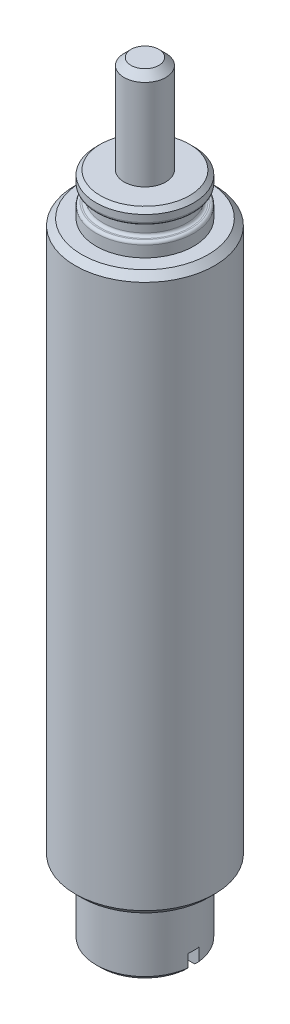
ISO-10303-21;
HEADER;
FILE_DESCRIPTION(('STEP AP214'),'2;1');
FILE_NAME('part.step','',(''),(''),'','','');
FILE_SCHEMA(('AUTOMOTIVE_DESIGN { 1 0 10303 214 1 1 1 1 }'));
ENDSEC;
DATA;
#1=APPLICATION_CONTEXT('core data for automotive mechanical design processes');
#2=APPLICATION_PROTOCOL_DEFINITION('international standard','automotive_design',2000,#1);
#3=PRODUCT_CONTEXT('',#1,'mechanical');
#4=PRODUCT('Part','Part','',(#3));
#5=PRODUCT_RELATED_PRODUCT_CATEGORY('part','',(#4));
#6=PRODUCT_DEFINITION_FORMATION('','',#4);
#7=PRODUCT_DEFINITION_CONTEXT('part definition',#1,'design');
#8=PRODUCT_DEFINITION('design','',#6,#7);
#9=PRODUCT_DEFINITION_SHAPE('','',#8);
#10=(LENGTH_UNIT() NAMED_UNIT(*) SI_UNIT(.MILLI.,.METRE.));
#11=(NAMED_UNIT(*) PLANE_ANGLE_UNIT() SI_UNIT($,.RADIAN.));
#12=(NAMED_UNIT(*) SI_UNIT($,.STERADIAN.) SOLID_ANGLE_UNIT());
#13=UNCERTAINTY_MEASURE_WITH_UNIT(LENGTH_MEASURE(1.E-05),#10,'distance_accuracy_value','');
#14=(GEOMETRIC_REPRESENTATION_CONTEXT(3) GLOBAL_UNCERTAINTY_ASSIGNED_CONTEXT((#13)) GLOBAL_UNIT_ASSIGNED_CONTEXT((#10,
#11,#12)) REPRESENTATION_CONTEXT('',''));
#15=CARTESIAN_POINT('',(0.,0.,0.));
#16=DIRECTION('',(0.,0.,1.));
#17=DIRECTION('',(1.,0.,0.));
#18=AXIS2_PLACEMENT_3D('',#15,#16,#17);
#19=CARTESIAN_POINT('',(0.,0.,0.));
#20=DIRECTION('',(0.,1.,0.));
#21=DIRECTION('',(0.,0.,1.));
#22=AXIS2_PLACEMENT_3D('',#19,#20,#21);
#23=CYLINDRICAL_SURFACE('',#22,3.5);
#24=CARTESIAN_POINT('',(0.,5.,0.));
#25=DIRECTION('',(0.,1.,0.));
#26=DIRECTION('',(0.,0.,1.));
#27=AXIS2_PLACEMENT_3D('',#24,#25,#26);
#28=CIRCLE('',#27,3.5);
#29=CARTESIAN_POINT('',(0.,5.,3.5));
#30=VERTEX_POINT('',#29);
#31=EDGE_CURVE('E417',#30,#30,#28,.T.);
#32=ORIENTED_EDGE('',*,*,#31,.F.);
#33=EDGE_LOOP('',(#32));
#34=FACE_BOUND('',#33,.T.);
#35=DIRECTION('',(0.,1.,0.));
#36=VECTOR('',#35,1.);
#37=CARTESIAN_POINT('',(3.47706773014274,0.,-0.4));
#38=LINE('',#37,#36);
#39=CARTESIAN_POINT('',(3.47706773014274,0.3,-0.4));
#40=VERTEX_POINT('',#39);
#41=CARTESIAN_POINT('',(3.47706773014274,1.2,-0.4));
#42=VERTEX_POINT('',#41);
#43=EDGE_CURVE('E235',#40,#42,#38,.T.);
#44=ORIENTED_EDGE('',*,*,#43,.F.);
#45=CARTESIAN_POINT('',(0.,0.3,0.));
#46=DIRECTION('',(0.,1.,0.));
#47=DIRECTION('',(0.,0.,1.));
#48=AXIS2_PLACEMENT_3D('',#45,#46,#47);
#49=CIRCLE('',#48,3.5);
#50=CARTESIAN_POINT('',(-3.47706773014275,0.300000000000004,-0.4));
#51=VERTEX_POINT('',#50);
#52=EDGE_CURVE('E416',#40,#51,#49,.T.);
#53=ORIENTED_EDGE('',*,*,#52,.T.);
#54=DIRECTION('',(0.,1.,0.));
#55=VECTOR('',#54,1.);
#56=CARTESIAN_POINT('',(-3.47706773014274,0.,-0.4));
#57=LINE('',#56,#55);
#58=CARTESIAN_POINT('',(-3.47706773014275,1.2,-0.4));
#59=VERTEX_POINT('',#58);
#60=EDGE_CURVE('E498',#59,#51,#57,.F.);
#61=ORIENTED_EDGE('',*,*,#60,.F.);
#62=CARTESIAN_POINT('',(0.,1.2,0.));
#63=DIRECTION('',(0.,1.,0.));
#64=DIRECTION('',(0.,0.,1.));
#65=AXIS2_PLACEMENT_3D('',#62,#63,#64);
#66=CIRCLE('',#65,3.5);
#67=CARTESIAN_POINT('',(-3.47706773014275,1.2,0.4));
#68=VERTEX_POINT('',#67);
#69=EDGE_CURVE('E171',#59,#68,#66,.T.);
#70=ORIENTED_EDGE('',*,*,#69,.T.);
#71=DIRECTION('',(0.,1.,0.));
#72=VECTOR('',#71,1.);
#73=CARTESIAN_POINT('',(-3.47706773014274,0.,0.4));
#74=LINE('',#73,#72);
#75=CARTESIAN_POINT('',(-3.47706773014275,0.300000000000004,0.4));
#76=VERTEX_POINT('',#75);
#77=EDGE_CURVE('E188',#68,#76,#74,.F.);
#78=ORIENTED_EDGE('',*,*,#77,.T.);
#79=CARTESIAN_POINT('',(3.47706773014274,0.3,0.4));
#80=VERTEX_POINT('',#79);
#81=EDGE_CURVE('E183',#76,#80,#49,.T.);
#82=ORIENTED_EDGE('',*,*,#81,.T.);
#83=DIRECTION('',(0.,1.,0.));
#84=VECTOR('',#83,1.);
#85=CARTESIAN_POINT('',(3.47706773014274,0.,0.4));
#86=LINE('',#85,#84);
#87=CARTESIAN_POINT('',(3.47706773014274,1.2,0.4));
#88=VERTEX_POINT('',#87);
#89=EDGE_CURVE('E174',#80,#88,#86,.T.);
#90=ORIENTED_EDGE('',*,*,#89,.T.);
#91=EDGE_CURVE('E160',#88,#42,#66,.T.);
#92=ORIENTED_EDGE('',*,*,#91,.T.);
#93=EDGE_LOOP('',(#44,#53,#61,#70,#78,#82,#90,#92));
#94=FACE_BOUND('',#93,.T.);
#95=ADVANCED_FACE('F16',(#34,#94),#23,.T.);
#96=CARTESIAN_POINT('',(0.,0.,0.));
#97=DIRECTION('',(0.,1.,0.));
#98=DIRECTION('',(0.,0.,1.));
#99=AXIS2_PLACEMENT_3D('',#96,#97,#98);
#100=CONICAL_SURFACE('',#99,3.2,0.785398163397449);
#101=CARTESIAN_POINT('',(-7.69366422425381,4.50405537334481,-0.4));
#102=CARTESIAN_POINT('',(-7.43089533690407,4.24164373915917,-0.4));
#103=CARTESIAN_POINT('',(-7.16811098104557,3.97924758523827,-0.4));
#104=CARTESIAN_POINT('',(-6.64248945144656,3.45450405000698,-0.4));
#105=CARTESIAN_POINT('',(-6.37965227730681,3.19215666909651,-0.4));
#106=CARTESIAN_POINT('',(-5.85386035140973,2.66748570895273,-0.4));
#107=CARTESIAN_POINT('',(-5.5909055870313,2.40516214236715,-0.4));
#108=CARTESIAN_POINT('',(-5.06489176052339,1.88062360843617,-0.4));
#109=CARTESIAN_POINT('',(-4.80183269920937,1.61840864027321,-0.4));
#110=CARTESIAN_POINT('',(-4.26890647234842,1.08754045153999,-0.4));
#111=CARTESIAN_POINT('',(-3.99903492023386,0.8188916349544,-0.4));
#112=CARTESIAN_POINT('',(-3.45897379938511,0.281901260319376,-0.4));
#113=CARTESIAN_POINT('',(-3.18878422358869,0.01355970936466,-0.4));
#114=CARTESIAN_POINT('',(-2.78302082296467,-0.388438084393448,-0.4));
#115=CARTESIAN_POINT('',(-2.64769430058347,-0.522343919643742,-0.4));
#116=CARTESIAN_POINT('',(-2.37677910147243,-0.789893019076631,-0.4));
#117=CARTESIAN_POINT('',(-2.24119042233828,-0.923536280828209,-0.4));
#118=CARTESIAN_POINT('',(-1.96958056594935,-1.19037082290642,-0.4));
#119=CARTESIAN_POINT('',(-1.83355940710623,-1.32356212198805,-0.4));
#120=CARTESIAN_POINT('',(-1.56073548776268,-1.58914124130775,-0.4));
#121=CARTESIAN_POINT('',(-1.4239327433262,-1.72152907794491,-0.4));
#122=CARTESIAN_POINT('',(-1.24903858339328,-1.88851837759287,-0.4));
#123=CARTESIAN_POINT('',(-1.21176639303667,-1.92397680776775,-0.4));
#124=CARTESIAN_POINT('',(-1.13704609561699,-1.99470900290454,-0.4));
#125=CARTESIAN_POINT('',(-1.09959798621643,-2.02998276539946,-0.4));
#126=CARTESIAN_POINT('',(-1.02456797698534,-2.1001976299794,-0.4));
#127=CARTESIAN_POINT('',(-0.986986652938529,-2.13513934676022,-0.4));
#128=CARTESIAN_POINT('',(-0.91151636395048,-2.20468743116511,-0.4));
#129=CARTESIAN_POINT('',(-0.873627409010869,-2.23929380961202,-0.4));
#130=CARTESIAN_POINT('',(-0.784515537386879,-2.31967237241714,-0.4));
#131=CARTESIAN_POINT('',(-0.733122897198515,-2.36525649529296,-0.4));
#132=CARTESIAN_POINT('',(-0.628842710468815,-2.45520239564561,-0.4));
#133=CARTESIAN_POINT('',(-0.575949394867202,-2.49955761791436,-0.4));
#134=CARTESIAN_POINT('',(-0.494596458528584,-2.56410877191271,-0.4));
#135=CARTESIAN_POINT('',(-0.467005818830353,-2.58539295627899,-0.4));
#136=CARTESIAN_POINT('',(-0.410979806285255,-2.62681128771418,-0.4));
#137=CARTESIAN_POINT('',(-0.382544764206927,-2.64694587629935,-0.4));
#138=CARTESIAN_POINT('',(-0.324620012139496,-2.68530788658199,-0.4));
#139=CARTESIAN_POINT('',(-0.29513683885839,-2.70354503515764,-0.4));
#140=CARTESIAN_POINT('',(-0.234534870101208,-2.73700088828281,-0.4));
#141=CARTESIAN_POINT('',(-0.203420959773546,-2.75222802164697,-0.4));
#142=CARTESIAN_POINT('',(-0.147017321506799,-2.77441580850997,-0.4));
#143=CARTESIAN_POINT('',(-0.122182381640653,-2.78248890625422,-0.4));
#144=CARTESIAN_POINT('',(-0.0715758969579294,-2.79438157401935,-0.4));
#145=CARTESIAN_POINT('',(-0.0458094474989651,-2.79822147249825,-0.4));
#146=CARTESIAN_POINT('',(0.00620454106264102,-2.80079877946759,-0.4));
#147=CARTESIAN_POINT('',(0.0324542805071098,-2.7994950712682,-0.4));
#148=CARTESIAN_POINT('',(0.0842976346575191,-2.79203046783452,-0.4));
#149=CARTESIAN_POINT('',(0.109888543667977,-2.78585208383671,-0.4));
#150=CARTESIAN_POINT('',(0.158689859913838,-2.77026790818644,-0.4));
#151=CARTESIAN_POINT('',(0.181955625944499,-2.76102617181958,-0.4));
#152=CARTESIAN_POINT('',(0.227476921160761,-2.74028867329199,-0.4));
#153=CARTESIAN_POINT('',(0.249730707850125,-2.72878919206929,-0.4));
#154=CARTESIAN_POINT('',(0.293539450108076,-2.70418317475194,-0.4));
#155=CARTESIAN_POINT('',(0.315087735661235,-2.69106498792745,-0.4));
#156=CARTESIAN_POINT('',(0.357478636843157,-2.6637816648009,-0.4));
#157=CARTESIAN_POINT('',(0.378321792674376,-2.64961735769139,-0.4));
#158=CARTESIAN_POINT('',(0.443390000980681,-2.60368777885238,-0.4));
#159=CARTESIAN_POINT('',(0.486662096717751,-2.57058285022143,-0.4));
#160=CARTESIAN_POINT('',(0.571818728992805,-2.50262339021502,-0.4));
#161=CARTESIAN_POINT('',(0.613702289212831,-2.46776766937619,-0.4));
#162=CARTESIAN_POINT('',(0.696666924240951,-2.39695793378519,-0.4));
#163=CARTESIAN_POINT('',(0.737746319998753,-2.36100195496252,-0.4));
#164=CARTESIAN_POINT('',(0.819308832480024,-2.2884493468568,-0.4));
#165=CARTESIAN_POINT('',(0.859792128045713,-2.25185291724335,-0.4));
#166=CARTESIAN_POINT('',(0.980455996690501,-2.14160002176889,-0.4));
#167=CARTESIAN_POINT('',(1.06005127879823,-2.0673042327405,-0.4));
#168=CARTESIAN_POINT('',(1.21833637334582,-1.91793900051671,-0.4));
#169=CARTESIAN_POINT('',(1.29702710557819,-1.84287052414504,-0.4));
#170=CARTESIAN_POINT('',(1.45350064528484,-1.69262203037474,-0.4));
#171=CARTESIAN_POINT('',(1.53128605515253,-1.61744472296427,-0.4));
#172=CARTESIAN_POINT('',(1.68654537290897,-1.46676892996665,-0.4));
#173=CARTESIAN_POINT('',(1.76401927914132,-1.39127044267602,-0.4));
#174=CARTESIAN_POINT('',(1.99613316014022,-1.16445343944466,-0.4));
#175=CARTESIAN_POINT('',(2.15046194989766,-1.01281661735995,-0.4));
#176=CARTESIAN_POINT('',(2.45876724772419,-0.709043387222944,-0.4));
#177=CARTESIAN_POINT('',(2.61274355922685,-0.556906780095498,-0.4));
#178=CARTESIAN_POINT('',(2.92043898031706,-0.252376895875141,-0.4));
#179=CARTESIAN_POINT('',(3.07415809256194,-0.0999836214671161,-0.4));
#180=CARTESIAN_POINT('',(3.53496294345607,0.357318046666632,-0.4));
#181=CARTESIAN_POINT('',(3.84181304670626,0.662463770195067,-0.4));
#182=CARTESIAN_POINT('',(4.45518005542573,1.27300829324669,-0.4));
#183=CARTESIAN_POINT('',(4.76169699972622,1.57840705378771,-0.4));
#184=CARTESIAN_POINT('',(5.28701682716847,2.10209890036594,-0.4));
#185=CARTESIAN_POINT('',(5.50586091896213,2.32035064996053,-0.4));
#186=CARTESIAN_POINT('',(5.94349757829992,2.7569229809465,-0.4));
#187=CARTESIAN_POINT('',(6.16229014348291,2.97524356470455,-0.4));
#188=CARTESIAN_POINT('',(6.59986905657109,3.41196517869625,-0.4));
#189=CARTESIAN_POINT('',(6.81865539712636,3.63036621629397,-0.4));
#190=CARTESIAN_POINT('',(7.25618636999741,4.06719281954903,-0.4));
#191=CARTESIAN_POINT('',(7.47493100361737,4.28561838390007,-0.4));
#192=CARTESIAN_POINT('',(7.69366422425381,4.50405537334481,-0.4));
#193=B_SPLINE_CURVE_WITH_KNOTS('',3,(#101,#102,#103,#104,#105,#106,#107,#108,#109,#110,#111,
#112,#113,#114,#115,#116,#117,#118,#119,#120,#121,#122,#123,#124,#125,#126,#127,#128,#129,#130,
#131,#132,#133,#134,#135,#136,#137,#138,#139,#140,#141,#142,#143,#144,#145,#146,#147,#148,#149,
#150,#151,#152,#153,#154,#155,#156,#157,#158,#159,#160,#161,#162,#163,#164,#165,#166,#167,#168,
#169,#170,#171,#172,#173,#174,#175,#176,#177,#178,#179,#180,#181,#182,#183,#184,#185,#186,#187,
#188,#189,#190,#191,#192),.UNSPECIFIED.,.F.,.F.,(4,2,2,2,2,2,2,2,2,2,2,2,2,2,2,2,2,2,2,2,2,2,2,
2,2,2,2,2,2,2,2,2,2,2,2,2,2,2,2,2,2,2,2,2,2,4),(0.,1.11407639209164,2.22816154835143,
3.34244594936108,4.45672180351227,5.59909892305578,6.74150190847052,7.31263781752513,
7.88377898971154,8.4548961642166,9.0260016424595,9.18033407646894,9.33466856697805,
9.48861374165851,9.64255393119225,9.84863311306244,10.0556562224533,10.1601771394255,
10.2646576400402,10.3685729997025,10.4721931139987,10.5502719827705,10.6279742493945,
10.7062989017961,10.784905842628,10.8598447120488,10.9349080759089,11.0105472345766,
11.0861270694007,11.2494684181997,11.4129222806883,11.5766872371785,11.7404020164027,
12.0670314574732,12.393292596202,12.7178209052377,13.0423509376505,13.6914249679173,
14.340800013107,14.9901683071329,16.2884120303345,17.5864833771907,18.5137045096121,
19.4409620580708,20.3683768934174,21.2957551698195),.UNSPECIFIED.);
#194=CARTESIAN_POINT('',(-3.17490157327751,0.,-0.4));
#195=VERTEX_POINT('',#194);
#196=EDGE_CURVE('E236',#51,#195,#193,.T.);
#197=ORIENTED_EDGE('',*,*,#196,.F.);
#198=ORIENTED_EDGE('',*,*,#52,.F.);
#199=CARTESIAN_POINT('',(3.17490157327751,0.,-0.4));
#200=VERTEX_POINT('',#199);
#201=EDGE_CURVE('E229',#200,#40,#193,.T.);
#202=ORIENTED_EDGE('',*,*,#201,.F.);
#203=CARTESIAN_POINT('',(0.,0.,0.));
#204=DIRECTION('',(0.,1.,0.));
#205=DIRECTION('',(0.,0.,1.));
#206=AXIS2_PLACEMENT_3D('',#203,#204,#205);
#207=CIRCLE('',#206,3.2);
#208=EDGE_CURVE('E414',#200,#195,#207,.T.);
#209=ORIENTED_EDGE('',*,*,#208,.T.);
#210=EDGE_LOOP('',(#197,#198,#202,#209));
#211=FACE_BOUND('',#210,.T.);
#212=ADVANCED_FACE('F246',(#211),#100,.T.);
#213=CARTESIAN_POINT('',(3.2,0.,0.));
#214=DIRECTION('',(0.,1.,0.));
#215=DIRECTION('',(0.,0.,1.));
#216=AXIS2_PLACEMENT_3D('',#213,#214,#215);
#217=PLANE('',#216);
#218=DIRECTION('',(1.,0.,0.));
#219=VECTOR('',#218,1.);
#220=CARTESIAN_POINT('',(-5.,0.,-0.4));
#221=LINE('',#220,#219);
#222=CARTESIAN_POINT('',(-1.44568322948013,0.,-0.4));
#223=VERTEX_POINT('',#222);
#224=EDGE_CURVE('E513',#195,#223,#221,.T.);
#225=ORIENTED_EDGE('',*,*,#224,.F.);
#226=ORIENTED_EDGE('',*,*,#208,.F.);
#227=CARTESIAN_POINT('',(1.4456832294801,0.,-0.4));
#228=VERTEX_POINT('',#227);
#229=EDGE_CURVE('E509',#228,#200,#221,.T.);
#230=ORIENTED_EDGE('',*,*,#229,.F.);
#231=CARTESIAN_POINT('',(0.,0.,0.));
#232=DIRECTION('',(0.,1.,0.));
#233=DIRECTION('',(-1.,0.,0.));
#234=AXIS2_PLACEMENT_3D('',#231,#232,#233);
#235=CIRCLE('',#234,1.5);
#236=EDGE_CURVE('E401',#228,#223,#235,.T.);
#237=ORIENTED_EDGE('',*,*,#236,.T.);
#238=EDGE_LOOP('',(#225,#226,#230,#237));
#239=FACE_BOUND('',#238,.T.);
#240=ADVANCED_FACE('F386',(#239),#217,.F.);
#241=CARTESIAN_POINT('',(0.,0.9295,0.));
#242=DIRECTION('',(0.,1.,0.));
#243=DIRECTION('',(-1.,0.,0.));
#244=AXIS2_PLACEMENT_3D('',#241,#242,#243);
#245=CONICAL_SURFACE('',#244,1.2295,0.785398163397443);
#246=CARTESIAN_POINT('',(0.,1.2,0.));
#247=DIRECTION('',(0.,1.,0.));
#248=DIRECTION('',(-1.,0.,0.));
#249=AXIS2_PLACEMENT_3D('',#246,#247,#248);
#250=CIRCLE('',#249,1.5);
#251=CARTESIAN_POINT('',(1.4456832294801,1.2,-0.4));
#252=VERTEX_POINT('',#251);
#253=CARTESIAN_POINT('',(-1.44568322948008,1.2,-0.4));
#254=VERTEX_POINT('',#253);
#255=EDGE_CURVE('E408',#252,#254,#250,.T.);
#256=ORIENTED_EDGE('',*,*,#255,.T.);
#257=CARTESIAN_POINT('',(-3.28322568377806,3.00750221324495,-0.4));
#258=CARTESIAN_POINT('',(-3.18446874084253,2.90947345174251,-0.4));
#259=CARTESIAN_POINT('',(-3.08568262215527,2.81147404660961,-0.4));
#260=CARTESIAN_POINT('',(-2.88799993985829,2.61553875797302,-0.4));
#261=CARTESIAN_POINT('',(-2.78910335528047,2.51760289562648,-0.4));
#262=CARTESIAN_POINT('',(-2.59071182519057,2.32136864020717,-0.4));
#263=CARTESIAN_POINT('',(-2.49121631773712,2.22307081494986,-0.4));
#264=CARTESIAN_POINT('',(-2.29208328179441,2.0266668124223,-0.4));
#265=CARTESIAN_POINT('',(-2.19244579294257,1.92856059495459,-0.4));
#266=CARTESIAN_POINT('',(-1.96151163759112,1.70172531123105,-0.4));
#267=CARTESIAN_POINT('',(-1.8301284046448,1.57308418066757,-0.4));
#268=CARTESIAN_POINT('',(-1.63242887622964,1.38065507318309,-0.4));
#269=CARTESIAN_POINT('',(-1.56639758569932,1.31657451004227,-0.4));
#270=CARTESIAN_POINT('',(-1.4340635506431,1.18870599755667,-0.4));
#271=CARTESIAN_POINT('',(-1.36776083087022,1.12491802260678,-0.4));
#272=CARTESIAN_POINT('',(-1.23499831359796,0.998013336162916,-0.4));
#273=CARTESIAN_POINT('',(-1.16854008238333,0.934894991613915,-0.4));
#274=CARTESIAN_POINT('',(-1.03495225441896,0.809327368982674,-0.4));
#275=CARTESIAN_POINT('',(-0.967822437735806,0.746878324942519,-0.4));
#276=CARTESIAN_POINT('',(-0.832572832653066,0.623254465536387,-0.4));
#277=CARTESIAN_POINT('',(-0.764454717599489,0.562077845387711,-0.4));
#278=CARTESIAN_POINT('',(-0.660700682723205,0.472164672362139,-0.4));
#279=CARTESIAN_POINT('',(-0.625862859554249,0.44251003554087,-0.4));
#280=CARTESIAN_POINT('',(-0.555398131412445,0.384156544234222,-0.4));
#281=CARTESIAN_POINT('',(-0.519771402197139,0.35545748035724,-0.4));
#282=CARTESIAN_POINT('',(-0.471576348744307,0.318326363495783,-0.4));
#283=CARTESIAN_POINT('',(-0.459547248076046,0.309195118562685,-0.4));
#284=CARTESIAN_POINT('',(-0.435332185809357,0.291142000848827,-0.4));
#285=CARTESIAN_POINT('',(-0.423146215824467,0.282220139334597,-0.4));
#286=CARTESIAN_POINT('',(-0.386298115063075,0.255815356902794,-0.4));
#287=CARTESIAN_POINT('',(-0.361363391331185,0.238706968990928,-0.4));
#288=CARTESIAN_POINT('',(-0.310793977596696,0.206183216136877,-0.4));
#289=CARTESIAN_POINT('',(-0.285170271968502,0.190751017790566,-0.4));
#290=CARTESIAN_POINT('',(-0.232668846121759,0.162221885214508,-0.4));
#291=CARTESIAN_POINT('',(-0.205793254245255,0.149121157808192,-0.4));
#292=CARTESIAN_POINT('',(-0.152820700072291,0.127576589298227,-0.4));
#293=CARTESIAN_POINT('',(-0.126851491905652,0.118831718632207,-0.4));
#294=CARTESIAN_POINT('',(-0.0738978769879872,0.105971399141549,-0.4));
#295=CARTESIAN_POINT('',(-0.0469214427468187,0.101825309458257,-0.4));
#296=CARTESIAN_POINT('',(0.00757988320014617,0.0991414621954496,-0.4));
#297=CARTESIAN_POINT('',(0.0351075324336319,0.100655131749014,-0.4));
#298=CARTESIAN_POINT('',(0.0894343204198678,0.108980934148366,-0.4));
#299=CARTESIAN_POINT('',(0.116228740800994,0.115821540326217,-0.4));
#300=CARTESIAN_POINT('',(0.167329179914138,0.132944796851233,-0.4));
#301=CARTESIAN_POINT('',(0.191692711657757,0.143065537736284,-0.4));
#302=CARTESIAN_POINT('',(0.239324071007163,0.165656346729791,-0.4));
#303=CARTESIAN_POINT('',(0.262589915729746,0.178130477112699,-0.4));
#304=CARTESIAN_POINT('',(0.308372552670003,0.204721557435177,-0.4));
#305=CARTESIAN_POINT('',(0.330882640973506,0.218849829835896,-0.4));
#306=CARTESIAN_POINT('',(0.375170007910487,0.248160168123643,-0.4));
#307=CARTESIAN_POINT('',(0.396947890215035,0.263341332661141,-0.4));
#308=CARTESIAN_POINT('',(0.465423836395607,0.312821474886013,-0.4));
#309=CARTESIAN_POINT('',(0.511124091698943,0.348490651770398,-0.4));
#310=CARTESIAN_POINT('',(0.60111579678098,0.421574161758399,-0.4));
#311=CARTESIAN_POINT('',(0.645406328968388,0.458989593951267,-0.4));
#312=CARTESIAN_POINT('',(0.733182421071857,0.534907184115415,-0.4));
#313=CARTESIAN_POINT('',(0.776666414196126,0.573411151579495,-0.4));
#314=CARTESIAN_POINT('',(0.863043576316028,0.651047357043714,-0.4));
#315=CARTESIAN_POINT('',(0.905936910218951,0.690179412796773,-0.4));
#316=CARTESIAN_POINT('',(1.03377834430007,0.807963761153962,-0.4));
#317=CARTESIAN_POINT('',(1.11815214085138,0.887238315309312,-0.4));
#318=CARTESIAN_POINT('',(1.28602008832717,1.04654226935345,-0.4));
#319=CARTESIAN_POINT('',(1.36951502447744,1.12657084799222,-0.4));
#320=CARTESIAN_POINT('',(1.6068798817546,1.35539824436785,-0.4));
#321=CARTESIAN_POINT('',(1.76018822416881,1.5047792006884,-0.4));
#322=CARTESIAN_POINT('',(2.06616858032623,1.80431358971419,-0.4));
#323=CARTESIAN_POINT('',(2.21884030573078,1.95446731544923,-0.4));
#324=CARTESIAN_POINT('',(2.52362768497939,2.25500278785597,-0.4));
#325=CARTESIAN_POINT('',(2.67574376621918,2.40538410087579,-0.4));
#326=CARTESIAN_POINT('',(2.97966526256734,2.70632765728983,-0.4));
#327=CARTESIAN_POINT('',(3.13147078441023,2.85688979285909,-0.4));
#328=CARTESIAN_POINT('',(3.28322568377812,3.00750221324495,-0.4));
#329=B_SPLINE_CURVE_WITH_KNOTS('',3,(#257,#258,#259,#260,#261,#262,#263,#264,#265,#266,#267,
#268,#269,#270,#271,#272,#273,#274,#275,#276,#277,#278,#279,#280,#281,#282,#283,#284,#285,#286,
#287,#288,#289,#290,#291,#292,#293,#294,#295,#296,#297,#298,#299,#300,#301,#302,#303,#304,#305,
#306,#307,#308,#309,#310,#311,#312,#313,#314,#315,#316,#317,#318,#319,#320,#321,#322,#323,#324,
#325,#326,#327,#328),.UNSPECIFIED.,.F.,.F.,(4,2,2,2,2,2,2,2,2,2,2,2,2,2,2,2,2,2,2,2,2,2,2,2,2,2,
2,2,2,2,2,2,2,2,2,4),(0.,0.417448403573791,0.834998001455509,1.25458853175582,1.674078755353,
2.2257022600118,2.50174156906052,2.77775624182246,3.05271706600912,3.32777109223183,
3.60240393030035,3.73964589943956,3.87685759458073,3.92216238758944,3.96746961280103,
4.05815098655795,4.14781550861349,4.23733279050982,4.31924673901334,4.40061156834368,
4.48271750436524,4.56526534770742,4.64423797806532,4.72334819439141,4.80303562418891,
4.88265565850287,5.05646761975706,5.23039049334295,5.40462179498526,5.57880342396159,
5.92610782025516,6.27306981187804,6.91521699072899,7.55762885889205,8.19933275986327,
8.84075615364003),.UNSPECIFIED.);
#330=CARTESIAN_POINT('',(-1.16261354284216,0.9295,-0.4));
#331=VERTEX_POINT('',#330);
#332=EDGE_CURVE('E202',#254,#331,#329,.T.);
#333=ORIENTED_EDGE('',*,*,#332,.T.);
#334=CARTESIAN_POINT('',(0.,0.9295,0.));
#335=DIRECTION('',(0.,1.,0.));
#336=DIRECTION('',(-1.,0.,0.));
#337=AXIS2_PLACEMENT_3D('',#334,#335,#336);
#338=CIRCLE('',#337,1.2295);
#339=CARTESIAN_POINT('',(1.16261354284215,0.9295,-0.4));
#340=VERTEX_POINT('',#339);
#341=EDGE_CURVE('E399',#340,#331,#338,.T.);
#342=ORIENTED_EDGE('',*,*,#341,.F.);
#343=EDGE_CURVE('E211',#340,#252,#329,.T.);
#344=ORIENTED_EDGE('',*,*,#343,.T.);
#345=EDGE_LOOP('',(#256,#333,#342,#344));
#346=FACE_BOUND('',#345,.T.);
#347=ADVANCED_FACE('F376',(#346),#245,.F.);
#348=CARTESIAN_POINT('',(0.,0.,0.));
#349=DIRECTION('',(0.,1.,0.));
#350=DIRECTION('',(-1.,0.,0.));
#351=AXIS2_PLACEMENT_3D('',#348,#349,#350);
#352=CYLINDRICAL_SURFACE('',#351,1.2295);
#353=CARTESIAN_POINT('',(0.,0.270500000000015,0.));
#354=DIRECTION('',(0.,1.,0.));
#355=DIRECTION('',(-1.,0.,0.));
#356=AXIS2_PLACEMENT_3D('',#353,#354,#355);
#357=CIRCLE('',#356,1.2295);
#358=CARTESIAN_POINT('',(1.16261354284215,0.270500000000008,-0.4));
#359=VERTEX_POINT('',#358);
#360=CARTESIAN_POINT('',(-1.16261354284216,0.270500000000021,-0.4));
#361=VERTEX_POINT('',#360);
#362=EDGE_CURVE('E391',#359,#361,#357,.T.);
#363=ORIENTED_EDGE('',*,*,#362,.F.);
#364=DIRECTION('',(0.,1.,0.));
#365=VECTOR('',#364,1.);
#366=CARTESIAN_POINT('',(1.16261354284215,0.,-0.4));
#367=LINE('',#366,#365);
#368=EDGE_CURVE('E210',#359,#340,#367,.T.);
#369=ORIENTED_EDGE('',*,*,#368,.T.);
#370=ORIENTED_EDGE('',*,*,#341,.T.);
#371=DIRECTION('',(0.,1.,0.));
#372=VECTOR('',#371,1.);
#373=CARTESIAN_POINT('',(-1.16261354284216,0.,-0.4));
#374=LINE('',#373,#372);
#375=EDGE_CURVE('E199',#331,#361,#374,.F.);
#376=ORIENTED_EDGE('',*,*,#375,.T.);
#377=EDGE_LOOP('',(#363,#369,#370,#376));
#378=FACE_BOUND('',#377,.T.);
#379=ADVANCED_FACE('F371',(#378),#352,.F.);
#380=CARTESIAN_POINT('',(0.,0.,0.));
#381=DIRECTION('',(0.,-1.,0.));
#382=DIRECTION('',(1.,0.,0.));
#383=AXIS2_PLACEMENT_3D('',#380,#381,#382);
#384=CONICAL_SURFACE('',#383,1.5,0.785398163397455);
#385=ORIENTED_EDGE('',*,*,#236,.F.);
#386=CARTESIAN_POINT('',(3.2832256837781,-1.80750221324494,-0.4));
#387=CARTESIAN_POINT('',(3.18446874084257,-1.7094734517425,-0.4));
#388=CARTESIAN_POINT('',(3.0856826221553,-1.6114740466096,-0.4));
#389=CARTESIAN_POINT('',(2.88799993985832,-1.41553875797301,-0.4));
#390=CARTESIAN_POINT('',(2.78910335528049,-1.31760289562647,-0.4));
#391=CARTESIAN_POINT('',(2.59071182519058,-1.12136864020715,-0.4));
#392=CARTESIAN_POINT('',(2.49121631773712,-1.02307081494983,-0.4));
#393=CARTESIAN_POINT('',(2.29208328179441,-0.826666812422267,-0.4));
#394=CARTESIAN_POINT('',(2.19244579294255,-0.728560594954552,-0.4));
#395=CARTESIAN_POINT('',(1.9615116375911,-0.501725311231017,-0.4));
#396=CARTESIAN_POINT('',(1.83012840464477,-0.373084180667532,-0.4));
#397=CARTESIAN_POINT('',(1.63242887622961,-0.180655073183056,-0.4));
#398=CARTESIAN_POINT('',(1.56639758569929,-0.116574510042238,-0.4));
#399=CARTESIAN_POINT('',(1.43406355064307,0.0112940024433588,-0.4));
#400=CARTESIAN_POINT('',(1.36776083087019,0.0750819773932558,-0.4));
#401=CARTESIAN_POINT('',(1.23499831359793,0.201986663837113,-0.4));
#402=CARTESIAN_POINT('',(1.1685400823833,0.265105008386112,-0.4));
#403=CARTESIAN_POINT('',(1.03495225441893,0.390672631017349,-0.4));
#404=CARTESIAN_POINT('',(0.967822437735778,0.453121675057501,-0.4));
#405=CARTESIAN_POINT('',(0.83257283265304,0.576745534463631,-0.4));
#406=CARTESIAN_POINT('',(0.764454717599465,0.637922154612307,-0.4));
#407=CARTESIAN_POINT('',(0.660700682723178,0.72783532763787,-0.4));
#408=CARTESIAN_POINT('',(0.625862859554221,0.757489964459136,-0.4));
#409=CARTESIAN_POINT('',(0.555398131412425,0.815843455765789,-0.4));
#410=CARTESIAN_POINT('',(0.519771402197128,0.84454251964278,-0.4));
#411=CARTESIAN_POINT('',(0.471576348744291,0.881673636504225,-0.4));
#412=CARTESIAN_POINT('',(0.459547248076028,0.890804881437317,-0.4));
#413=CARTESIAN_POINT('',(0.435332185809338,0.90885799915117,-0.4));
#414=CARTESIAN_POINT('',(0.42314621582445,0.9177798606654,-0.4));
#415=CARTESIAN_POINT('',(0.386298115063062,0.944184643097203,-0.4));
#416=CARTESIAN_POINT('',(0.361363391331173,0.961293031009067,-0.4));
#417=CARTESIAN_POINT('',(0.310793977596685,0.993816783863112,-0.4));
#418=CARTESIAN_POINT('',(0.285170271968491,1.00924898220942,-0.4));
#419=CARTESIAN_POINT('',(0.232668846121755,1.03777811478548,-0.4));
#420=CARTESIAN_POINT('',(0.205793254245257,1.05087884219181,-0.4));
#421=CARTESIAN_POINT('',(0.152820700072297,1.07242341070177,-0.4));
#422=CARTESIAN_POINT('',(0.126851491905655,1.08116828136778,-0.4));
#423=CARTESIAN_POINT('',(0.0738978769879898,1.09402860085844,-0.4));
#424=CARTESIAN_POINT('',(0.0469214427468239,1.09817469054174,-0.4));
#425=CARTESIAN_POINT('',(-0.00757988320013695,1.10085853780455,-0.4));
#426=CARTESIAN_POINT('',(-0.0351075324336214,1.09934486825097,-0.4));
#427=CARTESIAN_POINT('',(-0.0894343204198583,1.09101906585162,-0.4));
#428=CARTESIAN_POINT('',(-0.116228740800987,1.08417845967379,-0.4));
#429=CARTESIAN_POINT('',(-0.167329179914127,1.06705520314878,-0.4));
#430=CARTESIAN_POINT('',(-0.191692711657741,1.05693446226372,-0.4));
#431=CARTESIAN_POINT('',(-0.23932407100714,1.03434365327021,-0.4));
#432=CARTESIAN_POINT('',(-0.262589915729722,1.02186952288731,-0.4));
#433=CARTESIAN_POINT('',(-0.308372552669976,0.995278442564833,-0.4));
#434=CARTESIAN_POINT('',(-0.330882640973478,0.981150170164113,-0.4));
#435=CARTESIAN_POINT('',(-0.375170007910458,0.951839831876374,-0.4));
#436=CARTESIAN_POINT('',(-0.396947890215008,0.936658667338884,-0.4));
#437=CARTESIAN_POINT('',(-0.465423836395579,0.887178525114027,-0.4));
#438=CARTESIAN_POINT('',(-0.511124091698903,0.851509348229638,-0.4));
#439=CARTESIAN_POINT('',(-0.601115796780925,0.778425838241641,-0.4));
#440=CARTESIAN_POINT('',(-0.645406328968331,0.74101040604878,-0.4));
#441=CARTESIAN_POINT('',(-0.733182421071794,0.665092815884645,-0.4));
#442=CARTESIAN_POINT('',(-0.776666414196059,0.626588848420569,-0.4));
#443=CARTESIAN_POINT('',(-0.863043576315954,0.548952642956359,-0.4));
#444=CARTESIAN_POINT('',(-0.905936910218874,0.509820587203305,-0.4));
#445=CARTESIAN_POINT('',(-1.03377834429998,0.392036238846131,-0.4));
#446=CARTESIAN_POINT('',(-1.11815214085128,0.312761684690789,-0.4));
#447=CARTESIAN_POINT('',(-1.28602008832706,0.153457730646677,-0.4));
#448=CARTESIAN_POINT('',(-1.36951502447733,0.0734291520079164,-0.4));
#449=CARTESIAN_POINT('',(-1.6068798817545,-0.155398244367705,-0.4));
#450=CARTESIAN_POINT('',(-1.76018822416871,-0.304779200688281,-0.4));
#451=CARTESIAN_POINT('',(-2.06616858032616,-0.604313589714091,-0.4));
#452=CARTESIAN_POINT('',(-2.21884030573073,-0.754467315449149,-0.4));
#453=CARTESIAN_POINT('',(-2.52362768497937,-1.05500278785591,-0.4));
#454=CARTESIAN_POINT('',(-2.67574376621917,-1.20538410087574,-0.4));
#455=CARTESIAN_POINT('',(-2.97966526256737,-1.5063276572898,-0.4));
#456=CARTESIAN_POINT('',(-3.13147078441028,-1.65688979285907,-0.4));
#457=CARTESIAN_POINT('',(-3.28322568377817,-1.80750221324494,-0.4));
#458=B_SPLINE_CURVE_WITH_KNOTS('',3,(#386,#387,#388,#389,#390,#391,#392,#393,#394,#395,#396,
#397,#398,#399,#400,#401,#402,#403,#404,#405,#406,#407,#408,#409,#410,#411,#412,#413,#414,#415,
#416,#417,#418,#419,#420,#421,#422,#423,#424,#425,#426,#427,#428,#429,#430,#431,#432,#433,#434,
#435,#436,#437,#438,#439,#440,#441,#442,#443,#444,#445,#446,#447,#448,#449,#450,#451,#452,#453,
#454,#455,#456,#457),.UNSPECIFIED.,.F.,.F.,(4,2,2,2,2,2,2,2,2,2,2,2,2,2,2,2,2,2,2,2,2,2,2,2,2,2,
2,2,2,2,2,2,2,2,2,4),(0.,0.417448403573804,0.834998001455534,1.25458853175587,1.67407875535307,
2.22570226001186,2.50174156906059,2.77775624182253,3.05271706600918,3.32777109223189,
3.6024039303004,3.73964589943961,3.87685759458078,3.92216238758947,3.96746961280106,
4.05815098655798,4.14781550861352,4.23733279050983,4.31924673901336,4.40061156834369,
4.48271750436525,4.56526534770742,4.64423797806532,4.7233481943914,4.80303562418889,
4.88265565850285,5.05646761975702,5.23039049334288,5.40462179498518,5.57880342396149,
5.92610782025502,6.27306981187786,6.91521699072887,7.55762885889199,8.19933275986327,
8.84075615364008),.UNSPECIFIED.);
#459=EDGE_CURVE('E11',#228,#359,#458,.T.);
#460=ORIENTED_EDGE('',*,*,#459,.T.);
#461=ORIENTED_EDGE('',*,*,#362,.T.);
#462=EDGE_CURVE('E20',#361,#223,#458,.T.);
#463=ORIENTED_EDGE('',*,*,#462,.T.);
#464=EDGE_LOOP('',(#385,#460,#461,#463));
#465=FACE_BOUND('',#464,.T.);
#466=ADVANCED_FACE('F366',(#465),#384,.F.);
#467=CARTESIAN_POINT('',(0.,1.2,0.));
#468=DIRECTION('',(0.,-1.,0.));
#469=DIRECTION('',(1.,0.,0.));
#470=AXIS2_PLACEMENT_3D('',#467,#468,#469);
#471=PLANE('',#470);
#472=DIRECTION('',(-0.866025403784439,0.,-0.5));
#473=VECTOR('',#472,1.);
#474=CARTESIAN_POINT('',(0.324759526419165,1.2,-0.5625));
#475=LINE('',#474,#473);
#476=CARTESIAN_POINT('',(0.649519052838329,1.2,-0.375));
#477=VERTEX_POINT('',#476);
#478=CARTESIAN_POINT('',(0.,1.2,-0.75));
#479=VERTEX_POINT('',#478);
#480=EDGE_CURVE('E342',#477,#479,#475,.T.);
#481=ORIENTED_EDGE('',*,*,#480,.T.);
#482=DIRECTION('',(-0.866025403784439,0.,0.5));
#483=VECTOR('',#482,1.);
#484=CARTESIAN_POINT('',(-0.324759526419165,1.2,-0.5625));
#485=LINE('',#484,#483);
#486=CARTESIAN_POINT('',(-0.649519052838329,1.2,-0.375));
#487=VERTEX_POINT('',#486);
#488=EDGE_CURVE('E334',#479,#487,#485,.T.);
#489=ORIENTED_EDGE('',*,*,#488,.T.);
#490=DIRECTION('',(0.,0.,1.));
#491=VECTOR('',#490,1.);
#492=CARTESIAN_POINT('',(-0.649519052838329,1.2,0.));
#493=LINE('',#492,#491);
#494=CARTESIAN_POINT('',(-0.649519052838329,1.2,0.375));
#495=VERTEX_POINT('',#494);
#496=EDGE_CURVE('E351',#487,#495,#493,.T.);
#497=ORIENTED_EDGE('',*,*,#496,.T.);
#498=DIRECTION('',(0.866025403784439,0.,0.5));
#499=VECTOR('',#498,1.);
#500=CARTESIAN_POINT('',(-0.324759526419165,1.2,0.5625));
#501=LINE('',#500,#499);
#502=CARTESIAN_POINT('',(0.,1.2,0.75));
#503=VERTEX_POINT('',#502);
#504=EDGE_CURVE('E349',#495,#503,#501,.T.);
#505=ORIENTED_EDGE('',*,*,#504,.T.);
#506=DIRECTION('',(0.866025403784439,0.,-0.5));
#507=VECTOR('',#506,1.);
#508=CARTESIAN_POINT('',(0.324759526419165,1.2,0.5625));
#509=LINE('',#508,#507);
#510=CARTESIAN_POINT('',(0.649519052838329,1.2,0.375));
#511=VERTEX_POINT('',#510);
#512=EDGE_CURVE('E347',#503,#511,#509,.T.);
#513=ORIENTED_EDGE('',*,*,#512,.T.);
#514=DIRECTION('',(0.,0.,-1.));
#515=VECTOR('',#514,1.);
#516=CARTESIAN_POINT('',(0.649519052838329,1.2,0.));
#517=LINE('',#516,#515);
#518=EDGE_CURVE('E344',#511,#477,#517,.T.);
#519=ORIENTED_EDGE('',*,*,#518,.T.);
#520=EDGE_LOOP('',(#481,#489,#497,#505,#513,#519));
#521=FACE_BOUND('',#520,.T.);
#522=ORIENTED_EDGE('',*,*,#255,.F.);
#523=DIRECTION('',(-1.,0.,0.));
#524=VECTOR('',#523,1.);
#525=CARTESIAN_POINT('',(5.,1.2,-0.4));
#526=LINE('',#525,#524);
#527=EDGE_CURVE('E167',#42,#252,#526,.T.);
#528=ORIENTED_EDGE('',*,*,#527,.F.);
#529=ORIENTED_EDGE('',*,*,#91,.F.);
#530=DIRECTION('',(-1.,0.,0.));
#531=VECTOR('',#530,1.);
#532=CARTESIAN_POINT('',(5.,1.2,0.4));
#533=LINE('',#532,#531);
#534=CARTESIAN_POINT('',(1.4456832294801,1.2,0.4));
#535=VERTEX_POINT('',#534);
#536=EDGE_CURVE('E165',#88,#535,#533,.T.);
#537=ORIENTED_EDGE('',*,*,#536,.T.);
#538=CARTESIAN_POINT('',(-1.44568322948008,1.2,0.4));
#539=VERTEX_POINT('',#538);
#540=EDGE_CURVE('E409',#539,#535,#250,.T.);
#541=ORIENTED_EDGE('',*,*,#540,.F.);
#542=EDGE_CURVE('E178',#539,#68,#533,.T.);
#543=ORIENTED_EDGE('',*,*,#542,.T.);
#544=ORIENTED_EDGE('',*,*,#69,.F.);
#545=EDGE_CURVE('E515',#254,#59,#526,.T.);
#546=ORIENTED_EDGE('',*,*,#545,.F.);
#547=EDGE_LOOP('',(#522,#528,#529,#537,#541,#543,#544,#546));
#548=FACE_BOUND('',#547,.T.);
#549=ADVANCED_FACE('F163',(#521,#548),#471,.T.);
#550=CARTESIAN_POINT('',(0.,55.,0.));
#551=DIRECTION('',(0.,-1.,0.));
#552=DIRECTION('',(0.,0.,-1.));
#553=AXIS2_PLACEMENT_3D('',#550,#551,#552);
#554=PLANE('',#553);
#555=CARTESIAN_POINT('',(0.,55.,0.));
#556=DIRECTION('',(0.,1.,0.));
#557=DIRECTION('',(0.,0.,1.));
#558=AXIS2_PLACEMENT_3D('',#555,#556,#557);
#559=CIRCLE('',#558,1.);
#560=CARTESIAN_POINT('',(0.,55.,1.));
#561=VERTEX_POINT('',#560);
#562=EDGE_CURVE('E328',#561,#561,#559,.T.);
#563=ORIENTED_EDGE('',*,*,#562,.T.);
#564=EDGE_LOOP('',(#563));
#565=FACE_BOUND('',#564,.T.);
#566=ADVANCED_FACE('F18',(#565),#554,.F.);
#567=CARTESIAN_POINT('',(0.,54.5,0.));
#568=DIRECTION('',(0.,-1.,0.));
#569=DIRECTION('',(0.,0.,-1.));
#570=AXIS2_PLACEMENT_3D('',#567,#568,#569);
#571=CONICAL_SURFACE('',#570,1.5,0.785398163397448);
#572=ORIENTED_EDGE('',*,*,#562,.F.);
#573=EDGE_LOOP('',(#572));
#574=FACE_BOUND('',#573,.T.);
#575=CARTESIAN_POINT('',(0.,54.5,0.));
#576=DIRECTION('',(0.,1.,0.));
#577=DIRECTION('',(0.,0.,1.));
#578=AXIS2_PLACEMENT_3D('',#575,#576,#577);
#579=CIRCLE('',#578,1.5);
#580=CARTESIAN_POINT('',(0.,54.5,1.5));
#581=VERTEX_POINT('',#580);
#582=EDGE_CURVE('E331',#581,#581,#579,.T.);
#583=ORIENTED_EDGE('',*,*,#582,.T.);
#584=EDGE_LOOP('',(#583));
#585=FACE_BOUND('',#584,.T.);
#586=ADVANCED_FACE('F316',(#574,#585),#571,.T.);
#587=CARTESIAN_POINT('',(0.,0.,0.));
#588=DIRECTION('',(0.,1.,0.));
#589=DIRECTION('',(0.,0.,1.));
#590=AXIS2_PLACEMENT_3D('',#587,#588,#589);
#591=CYLINDRICAL_SURFACE('',#590,1.5);
#592=ORIENTED_EDGE('',*,*,#582,.F.);
#593=EDGE_LOOP('',(#592));
#594=FACE_BOUND('',#593,.T.);
#595=CARTESIAN_POINT('',(0.,48.,0.));
#596=DIRECTION('',(0.,1.,0.));
#597=DIRECTION('',(0.,0.,1.));
#598=AXIS2_PLACEMENT_3D('',#595,#596,#597);
#599=CIRCLE('',#598,1.5);
#600=CARTESIAN_POINT('',(0.,48.,1.5));
#601=VERTEX_POINT('',#600);
#602=EDGE_CURVE('E332',#601,#601,#599,.T.);
#603=ORIENTED_EDGE('',*,*,#602,.T.);
#604=EDGE_LOOP('',(#603));
#605=FACE_BOUND('',#604,.T.);
#606=ADVANCED_FACE('F313',(#594,#605),#591,.T.);
#607=CARTESIAN_POINT('',(1.5,48.,0.));
#608=DIRECTION('',(0.,-1.,0.));
#609=DIRECTION('',(0.,0.,-1.));
#610=AXIS2_PLACEMENT_3D('',#607,#608,#609);
#611=PLANE('',#610);
#612=ORIENTED_EDGE('',*,*,#602,.F.);
#613=EDGE_LOOP('',(#612));
#614=FACE_BOUND('',#613,.T.);
#615=CARTESIAN_POINT('',(0.,48.,0.));
#616=DIRECTION('',(0.,1.,0.));
#617=DIRECTION('',(0.,0.,1.));
#618=AXIS2_PLACEMENT_3D('',#615,#616,#617);
#619=CIRCLE('',#618,3.2);
#620=CARTESIAN_POINT('',(0.,48.,3.2));
#621=VERTEX_POINT('',#620);
#622=EDGE_CURVE('E337',#621,#621,#619,.T.);
#623=ORIENTED_EDGE('',*,*,#622,.T.);
#624=EDGE_LOOP('',(#623));
#625=FACE_BOUND('',#624,.T.);
#626=ADVANCED_FACE('F309',(#614,#625),#611,.F.);
#627=CARTESIAN_POINT('',(0.,47.7,0.));
#628=DIRECTION('',(0.,-1.,0.));
#629=DIRECTION('',(0.,0.,-1.));
#630=AXIS2_PLACEMENT_3D('',#627,#628,#629);
#631=CONICAL_SURFACE('',#630,3.5,0.785398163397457);
#632=ORIENTED_EDGE('',*,*,#622,.F.);
#633=EDGE_LOOP('',(#632));
#634=FACE_BOUND('',#633,.T.);
#635=CARTESIAN_POINT('',(0.,47.7,0.));
#636=DIRECTION('',(0.,1.,0.));
#637=DIRECTION('',(0.,0.,1.));
#638=AXIS2_PLACEMENT_3D('',#635,#636,#637);
#639=CIRCLE('',#638,3.5);
#640=CARTESIAN_POINT('',(0.,47.7,3.5));
#641=VERTEX_POINT('',#640);
#642=EDGE_CURVE('E459',#641,#641,#639,.T.);
#643=ORIENTED_EDGE('',*,*,#642,.T.);
#644=EDGE_LOOP('',(#643));
#645=FACE_BOUND('',#644,.T.);
#646=ADVANCED_FACE('F305',(#634,#645),#631,.T.);
#647=CARTESIAN_POINT('',(0.,0.,0.));
#648=DIRECTION('',(0.,1.,0.));
#649=DIRECTION('',(0.,0.,1.));
#650=AXIS2_PLACEMENT_3D('',#647,#648,#649);
#651=CYLINDRICAL_SURFACE('',#650,3.5);
#652=ORIENTED_EDGE('',*,*,#642,.F.);
#653=EDGE_LOOP('',(#652));
#654=FACE_BOUND('',#653,.T.);
#655=CARTESIAN_POINT('',(0.,47.2,0.));
#656=DIRECTION('',(0.,1.,0.));
#657=DIRECTION('',(0.,0.,1.));
#658=AXIS2_PLACEMENT_3D('',#655,#656,#657);
#659=CIRCLE('',#658,3.5);
#660=CARTESIAN_POINT('',(0.,47.2,3.5));
#661=VERTEX_POINT('',#660);
#662=EDGE_CURVE('E456',#661,#661,#659,.T.);
#663=ORIENTED_EDGE('',*,*,#662,.T.);
#664=EDGE_LOOP('',(#663));
#665=FACE_BOUND('',#664,.T.);
#666=ADVANCED_FACE('F301',(#654,#665),#651,.T.);
#667=CARTESIAN_POINT('',(0.,47.2,0.));
#668=DIRECTION('',(0.,1.,0.));
#669=DIRECTION('',(0.,0.,1.));
#670=AXIS2_PLACEMENT_3D('',#667,#668,#669);
#671=TOROIDAL_SURFACE('',#670,3.3,0.2);
#672=ORIENTED_EDGE('',*,*,#662,.F.);
#673=EDGE_LOOP('',(#672));
#674=FACE_BOUND('',#673,.T.);
#675=CARTESIAN_POINT('',(0.,47.,0.));
#676=DIRECTION('',(0.,1.,0.));
#677=DIRECTION('',(0.,0.,1.));
#678=AXIS2_PLACEMENT_3D('',#675,#676,#677);
#679=CIRCLE('',#678,3.3);
#680=CARTESIAN_POINT('',(0.,47.,3.3));
#681=VERTEX_POINT('',#680);
#682=EDGE_CURVE('E453',#681,#681,#679,.T.);
#683=ORIENTED_EDGE('',*,*,#682,.T.);
#684=EDGE_LOOP('',(#683));
#685=FACE_BOUND('',#684,.T.);
#686=ADVANCED_FACE('F297',(#674,#685),#671,.T.);
#687=CARTESIAN_POINT('',(3.3,47.,0.));
#688=DIRECTION('',(0.,1.,0.));
#689=DIRECTION('',(0.,0.,1.));
#690=AXIS2_PLACEMENT_3D('',#687,#688,#689);
#691=PLANE('',#690);
#692=ORIENTED_EDGE('',*,*,#682,.F.);
#693=EDGE_LOOP('',(#692));
#694=FACE_BOUND('',#693,.T.);
#695=CARTESIAN_POINT('',(0.,47.,0.));
#696=DIRECTION('',(0.,1.,0.));
#697=DIRECTION('',(0.,0.,1.));
#698=AXIS2_PLACEMENT_3D('',#695,#696,#697);
#699=CIRCLE('',#698,3.2);
#700=CARTESIAN_POINT('',(0.,47.,3.2));
#701=VERTEX_POINT('',#700);
#702=EDGE_CURVE('E450',#701,#701,#699,.T.);
#703=ORIENTED_EDGE('',*,*,#702,.T.);
#704=EDGE_LOOP('',(#703));
#705=FACE_BOUND('',#704,.T.);
#706=ADVANCED_FACE('F293',(#694,#705),#691,.F.);
#707=CARTESIAN_POINT('',(0.,46.8,0.));
#708=DIRECTION('',(0.,1.,0.));
#709=DIRECTION('',(0.,0.,1.));
#710=AXIS2_PLACEMENT_3D('',#707,#708,#709);
#711=TOROIDAL_SURFACE('',#710,3.2,0.200000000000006);
#712=ORIENTED_EDGE('',*,*,#702,.F.);
#713=EDGE_LOOP('',(#712));
#714=FACE_BOUND('',#713,.T.);
#715=CARTESIAN_POINT('',(0.,46.8,0.));
#716=DIRECTION('',(0.,1.,0.));
#717=DIRECTION('',(0.,0.,1.));
#718=AXIS2_PLACEMENT_3D('',#715,#716,#717);
#719=CIRCLE('',#718,3.);
#720=CARTESIAN_POINT('',(0.,46.8,3.));
#721=VERTEX_POINT('',#720);
#722=EDGE_CURVE('E447',#721,#721,#719,.T.);
#723=ORIENTED_EDGE('',*,*,#722,.T.);
#724=EDGE_LOOP('',(#723));
#725=FACE_BOUND('',#724,.T.);
#726=ADVANCED_FACE('F289',(#714,#725),#711,.F.);
#727=CARTESIAN_POINT('',(0.,0.,0.));
#728=DIRECTION('',(0.,1.,0.));
#729=DIRECTION('',(0.,0.,1.));
#730=AXIS2_PLACEMENT_3D('',#727,#728,#729);
#731=CYLINDRICAL_SURFACE('',#730,3.);
#732=ORIENTED_EDGE('',*,*,#722,.F.);
#733=EDGE_LOOP('',(#732));
#734=FACE_BOUND('',#733,.T.);
#735=CARTESIAN_POINT('',(0.,46.2,0.));
#736=DIRECTION('',(0.,1.,0.));
#737=DIRECTION('',(0.,0.,1.));
#738=AXIS2_PLACEMENT_3D('',#735,#736,#737);
#739=CIRCLE('',#738,3.);
#740=CARTESIAN_POINT('',(0.,46.2,3.));
#741=VERTEX_POINT('',#740);
#742=EDGE_CURVE('E444',#741,#741,#739,.T.);
#743=ORIENTED_EDGE('',*,*,#742,.T.);
#744=EDGE_LOOP('',(#743));
#745=FACE_BOUND('',#744,.T.);
#746=ADVANCED_FACE('F285',(#734,#745),#731,.T.);
#747=CARTESIAN_POINT('',(0.,46.2,0.));
#748=DIRECTION('',(0.,1.,0.));
#749=DIRECTION('',(0.,0.,1.));
#750=AXIS2_PLACEMENT_3D('',#747,#748,#749);
#751=TOROIDAL_SURFACE('',#750,3.2,0.2);
#752=ORIENTED_EDGE('',*,*,#742,.F.);
#753=EDGE_LOOP('',(#752));
#754=FACE_BOUND('',#753,.T.);
#755=CARTESIAN_POINT('',(0.,46.,0.));
#756=DIRECTION('',(0.,1.,0.));
#757=DIRECTION('',(0.,0.,1.));
#758=AXIS2_PLACEMENT_3D('',#755,#756,#757);
#759=CIRCLE('',#758,3.2);
#760=CARTESIAN_POINT('',(0.,46.,3.2));
#761=VERTEX_POINT('',#760);
#762=EDGE_CURVE('E441',#761,#761,#759,.T.);
#763=ORIENTED_EDGE('',*,*,#762,.T.);
#764=EDGE_LOOP('',(#763));
#765=FACE_BOUND('',#764,.T.);
#766=ADVANCED_FACE('F281',(#754,#765),#751,.F.);
#767=CARTESIAN_POINT('',(3.2,46.,0.));
#768=DIRECTION('',(0.,-1.,0.));
#769=DIRECTION('',(0.,0.,-1.));
#770=AXIS2_PLACEMENT_3D('',#767,#768,#769);
#771=PLANE('',#770);
#772=ORIENTED_EDGE('',*,*,#762,.F.);
#773=EDGE_LOOP('',(#772));
#774=FACE_BOUND('',#773,.T.);
#775=CARTESIAN_POINT('',(0.,46.,0.));
#776=DIRECTION('',(0.,1.,0.));
#777=DIRECTION('',(0.,0.,1.));
#778=AXIS2_PLACEMENT_3D('',#775,#776,#777);
#779=CIRCLE('',#778,3.3);
#780=CARTESIAN_POINT('',(0.,46.,3.3));
#781=VERTEX_POINT('',#780);
#782=EDGE_CURVE('E438',#781,#781,#779,.T.);
#783=ORIENTED_EDGE('',*,*,#782,.T.);
#784=EDGE_LOOP('',(#783));
#785=FACE_BOUND('',#784,.T.);
#786=ADVANCED_FACE('F277',(#774,#785),#771,.F.);
#787=CARTESIAN_POINT('',(0.,45.8,0.));
#788=DIRECTION('',(0.,1.,0.));
#789=DIRECTION('',(0.,0.,1.));
#790=AXIS2_PLACEMENT_3D('',#787,#788,#789);
#791=TOROIDAL_SURFACE('',#790,3.3,0.200000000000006);
#792=ORIENTED_EDGE('',*,*,#782,.F.);
#793=EDGE_LOOP('',(#792));
#794=FACE_BOUND('',#793,.T.);
#795=CARTESIAN_POINT('',(0.,45.8,0.));
#796=DIRECTION('',(0.,1.,0.));
#797=DIRECTION('',(0.,0.,1.));
#798=AXIS2_PLACEMENT_3D('',#795,#796,#797);
#799=CIRCLE('',#798,3.5);
#800=CARTESIAN_POINT('',(0.,45.8,3.5));
#801=VERTEX_POINT('',#800);
#802=EDGE_CURVE('E435',#801,#801,#799,.T.);
#803=ORIENTED_EDGE('',*,*,#802,.T.);
#804=EDGE_LOOP('',(#803));
#805=FACE_BOUND('',#804,.T.);
#806=ADVANCED_FACE('F273',(#794,#805),#791,.T.);
#807=CARTESIAN_POINT('',(0.,0.,0.));
#808=DIRECTION('',(0.,1.,0.));
#809=DIRECTION('',(0.,0.,1.));
#810=AXIS2_PLACEMENT_3D('',#807,#808,#809);
#811=CYLINDRICAL_SURFACE('',#810,3.5);
#812=ORIENTED_EDGE('',*,*,#802,.F.);
#813=EDGE_LOOP('',(#812));
#814=FACE_BOUND('',#813,.T.);
#815=CARTESIAN_POINT('',(0.,45.,0.));
#816=DIRECTION('',(0.,1.,0.));
#817=DIRECTION('',(0.,0.,1.));
#818=AXIS2_PLACEMENT_3D('',#815,#816,#817);
#819=CIRCLE('',#818,3.5);
#820=CARTESIAN_POINT('',(0.,45.,3.5));
#821=VERTEX_POINT('',#820);
#822=EDGE_CURVE('E432',#821,#821,#819,.T.);
#823=ORIENTED_EDGE('',*,*,#822,.T.);
#824=EDGE_LOOP('',(#823));
#825=FACE_BOUND('',#824,.T.);
#826=ADVANCED_FACE('F269',(#814,#825),#811,.T.);
#827=CARTESIAN_POINT('',(3.5,45.,0.));
#828=DIRECTION('',(0.,-1.,0.));
#829=DIRECTION('',(0.,0.,-1.));
#830=AXIS2_PLACEMENT_3D('',#827,#828,#829);
#831=PLANE('',#830);
#832=ORIENTED_EDGE('',*,*,#822,.F.);
#833=EDGE_LOOP('',(#832));
#834=FACE_BOUND('',#833,.T.);
#835=CARTESIAN_POINT('',(0.,45.,0.));
#836=DIRECTION('',(0.,1.,0.));
#837=DIRECTION('',(0.,0.,1.));
#838=AXIS2_PLACEMENT_3D('',#835,#836,#837);
#839=CIRCLE('',#838,4.54);
#840=CARTESIAN_POINT('',(0.,45.,4.54));
#841=VERTEX_POINT('',#840);
#842=EDGE_CURVE('E429',#841,#841,#839,.T.);
#843=ORIENTED_EDGE('',*,*,#842,.T.);
#844=EDGE_LOOP('',(#843));
#845=FACE_BOUND('',#844,.T.);
#846=ADVANCED_FACE('F265',(#834,#845),#831,.F.);
#847=CARTESIAN_POINT('',(0.,44.54,0.));
#848=DIRECTION('',(0.,-1.,0.));
#849=DIRECTION('',(0.,0.,-1.));
#850=AXIS2_PLACEMENT_3D('',#847,#848,#849);
#851=CONICAL_SURFACE('',#850,5.,0.785398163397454);
#852=ORIENTED_EDGE('',*,*,#842,.F.);
#853=EDGE_LOOP('',(#852));
#854=FACE_BOUND('',#853,.T.);
#855=CARTESIAN_POINT('',(0.,44.54,0.));
#856=DIRECTION('',(0.,1.,0.));
#857=DIRECTION('',(0.,0.,1.));
#858=AXIS2_PLACEMENT_3D('',#855,#856,#857);
#859=CIRCLE('',#858,5.);
#860=CARTESIAN_POINT('',(0.,44.54,5.));
#861=VERTEX_POINT('',#860);
#862=EDGE_CURVE('E426',#861,#861,#859,.T.);
#863=ORIENTED_EDGE('',*,*,#862,.T.);
#864=EDGE_LOOP('',(#863));
#865=FACE_BOUND('',#864,.T.);
#866=ADVANCED_FACE('F261',(#854,#865),#851,.T.);
#867=CARTESIAN_POINT('',(0.,0.,0.));
#868=DIRECTION('',(0.,1.,0.));
#869=DIRECTION('',(0.,0.,1.));
#870=AXIS2_PLACEMENT_3D('',#867,#868,#869);
#871=CYLINDRICAL_SURFACE('',#870,5.);
#872=ORIENTED_EDGE('',*,*,#862,.F.);
#873=EDGE_LOOP('',(#872));
#874=FACE_BOUND('',#873,.T.);
#875=CARTESIAN_POINT('',(0.,5.46,0.));
#876=DIRECTION('',(0.,1.,0.));
#877=DIRECTION('',(0.,0.,1.));
#878=AXIS2_PLACEMENT_3D('',#875,#876,#877);
#879=CIRCLE('',#878,5.);
#880=CARTESIAN_POINT('',(0.,5.46,5.));
#881=VERTEX_POINT('',#880);
#882=EDGE_CURVE('E423',#881,#881,#879,.T.);
#883=ORIENTED_EDGE('',*,*,#882,.T.);
#884=EDGE_LOOP('',(#883));
#885=FACE_BOUND('',#884,.T.);
#886=ADVANCED_FACE('F257',(#874,#885),#871,.T.);
#887=CARTESIAN_POINT('',(0.,5.,0.));
#888=DIRECTION('',(0.,1.,0.));
#889=DIRECTION('',(0.,0.,1.));
#890=AXIS2_PLACEMENT_3D('',#887,#888,#889);
#891=CONICAL_SURFACE('',#890,4.54,0.785398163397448);
#892=ORIENTED_EDGE('',*,*,#882,.F.);
#893=EDGE_LOOP('',(#892));
#894=FACE_BOUND('',#893,.T.);
#895=CARTESIAN_POINT('',(0.,5.,0.));
#896=DIRECTION('',(0.,1.,0.));
#897=DIRECTION('',(0.,0.,1.));
#898=AXIS2_PLACEMENT_3D('',#895,#896,#897);
#899=CIRCLE('',#898,4.54);
#900=CARTESIAN_POINT('',(0.,5.,4.54));
#901=VERTEX_POINT('',#900);
#902=EDGE_CURVE('E420',#901,#901,#899,.T.);
#903=ORIENTED_EDGE('',*,*,#902,.T.);
#904=EDGE_LOOP('',(#903));
#905=FACE_BOUND('',#904,.T.);
#906=ADVANCED_FACE('F253',(#894,#905),#891,.T.);
#907=CARTESIAN_POINT('',(4.54,5.,0.));
#908=DIRECTION('',(0.,1.,0.));
#909=DIRECTION('',(0.,0.,1.));
#910=AXIS2_PLACEMENT_3D('',#907,#908,#909);
#911=PLANE('',#910);
#912=ORIENTED_EDGE('',*,*,#902,.F.);
#913=EDGE_LOOP('',(#912));
#914=FACE_BOUND('',#913,.T.);
#915=ORIENTED_EDGE('',*,*,#31,.T.);
#916=EDGE_LOOP('',(#915));
#917=FACE_BOUND('',#916,.T.);
#918=ADVANCED_FACE('F244',(#914,#917),#911,.F.);
#919=ORIENTED_EDGE('',*,*,#81,.F.);
#920=CARTESIAN_POINT('',(-7.69366422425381,4.50405537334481,0.4));
#921=CARTESIAN_POINT('',(-7.43089533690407,4.24164373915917,0.4));
#922=CARTESIAN_POINT('',(-7.16811098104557,3.97924758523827,0.4));
#923=CARTESIAN_POINT('',(-6.64248945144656,3.45450405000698,0.4));
#924=CARTESIAN_POINT('',(-6.37965227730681,3.19215666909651,0.4));
#925=CARTESIAN_POINT('',(-5.85386035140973,2.66748570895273,0.4));
#926=CARTESIAN_POINT('',(-5.5909055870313,2.40516214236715,0.4));
#927=CARTESIAN_POINT('',(-5.06489176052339,1.88062360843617,0.4));
#928=CARTESIAN_POINT('',(-4.80183269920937,1.61840864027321,0.4));
#929=CARTESIAN_POINT('',(-4.26890647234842,1.08754045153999,0.4));
#930=CARTESIAN_POINT('',(-3.99903492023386,0.8188916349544,0.4));
#931=CARTESIAN_POINT('',(-3.45897379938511,0.281901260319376,0.4));
#932=CARTESIAN_POINT('',(-3.18878422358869,0.01355970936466,0.4));
#933=CARTESIAN_POINT('',(-2.78302082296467,-0.388438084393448,0.4));
#934=CARTESIAN_POINT('',(-2.64769430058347,-0.522343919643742,0.4));
#935=CARTESIAN_POINT('',(-2.37677910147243,-0.789893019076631,0.4));
#936=CARTESIAN_POINT('',(-2.24119042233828,-0.923536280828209,0.4));
#937=CARTESIAN_POINT('',(-1.96958056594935,-1.19037082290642,0.4));
#938=CARTESIAN_POINT('',(-1.83355940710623,-1.32356212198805,0.4));
#939=CARTESIAN_POINT('',(-1.56073548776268,-1.58914124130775,0.4));
#940=CARTESIAN_POINT('',(-1.4239327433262,-1.72152907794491,0.4));
#941=CARTESIAN_POINT('',(-1.24903858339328,-1.88851837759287,0.4));
#942=CARTESIAN_POINT('',(-1.21176639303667,-1.92397680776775,0.4));
#943=CARTESIAN_POINT('',(-1.13704609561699,-1.99470900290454,0.4));
#944=CARTESIAN_POINT('',(-1.09959798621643,-2.02998276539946,0.4));
#945=CARTESIAN_POINT('',(-1.02456797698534,-2.1001976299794,0.4));
#946=CARTESIAN_POINT('',(-0.986986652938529,-2.13513934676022,0.4));
#947=CARTESIAN_POINT('',(-0.91151636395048,-2.20468743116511,0.4));
#948=CARTESIAN_POINT('',(-0.873627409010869,-2.23929380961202,0.4));
#949=CARTESIAN_POINT('',(-0.784515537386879,-2.31967237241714,0.4));
#950=CARTESIAN_POINT('',(-0.733122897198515,-2.36525649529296,0.4));
#951=CARTESIAN_POINT('',(-0.628842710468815,-2.45520239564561,0.4));
#952=CARTESIAN_POINT('',(-0.575949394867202,-2.49955761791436,0.4));
#953=CARTESIAN_POINT('',(-0.494596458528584,-2.56410877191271,0.4));
#954=CARTESIAN_POINT('',(-0.467005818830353,-2.58539295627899,0.4));
#955=CARTESIAN_POINT('',(-0.410979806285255,-2.62681128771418,0.4));
#956=CARTESIAN_POINT('',(-0.382544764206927,-2.64694587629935,0.4));
#957=CARTESIAN_POINT('',(-0.324620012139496,-2.68530788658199,0.4));
#958=CARTESIAN_POINT('',(-0.29513683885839,-2.70354503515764,0.4));
#959=CARTESIAN_POINT('',(-0.234534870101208,-2.73700088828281,0.4));
#960=CARTESIAN_POINT('',(-0.203420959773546,-2.75222802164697,0.4));
#961=CARTESIAN_POINT('',(-0.147017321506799,-2.77441580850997,0.4));
#962=CARTESIAN_POINT('',(-0.122182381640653,-2.78248890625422,0.4));
#963=CARTESIAN_POINT('',(-0.0715758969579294,-2.79438157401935,0.4));
#964=CARTESIAN_POINT('',(-0.0458094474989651,-2.79822147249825,0.4));
#965=CARTESIAN_POINT('',(0.00620454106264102,-2.80079877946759,0.4));
#966=CARTESIAN_POINT('',(0.0324542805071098,-2.7994950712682,0.4));
#967=CARTESIAN_POINT('',(0.0842976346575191,-2.79203046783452,0.4));
#968=CARTESIAN_POINT('',(0.109888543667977,-2.78585208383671,0.4));
#969=CARTESIAN_POINT('',(0.158689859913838,-2.77026790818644,0.4));
#970=CARTESIAN_POINT('',(0.181955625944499,-2.76102617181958,0.4));
#971=CARTESIAN_POINT('',(0.227476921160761,-2.74028867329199,0.4));
#972=CARTESIAN_POINT('',(0.249730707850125,-2.72878919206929,0.4));
#973=CARTESIAN_POINT('',(0.293539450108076,-2.70418317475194,0.4));
#974=CARTESIAN_POINT('',(0.315087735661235,-2.69106498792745,0.4));
#975=CARTESIAN_POINT('',(0.357478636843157,-2.6637816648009,0.4));
#976=CARTESIAN_POINT('',(0.378321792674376,-2.64961735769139,0.4));
#977=CARTESIAN_POINT('',(0.443390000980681,-2.60368777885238,0.4));
#978=CARTESIAN_POINT('',(0.486662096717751,-2.57058285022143,0.4));
#979=CARTESIAN_POINT('',(0.571818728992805,-2.50262339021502,0.4));
#980=CARTESIAN_POINT('',(0.613702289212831,-2.46776766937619,0.4));
#981=CARTESIAN_POINT('',(0.696666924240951,-2.39695793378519,0.4));
#982=CARTESIAN_POINT('',(0.737746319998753,-2.36100195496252,0.4));
#983=CARTESIAN_POINT('',(0.819308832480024,-2.2884493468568,0.4));
#984=CARTESIAN_POINT('',(0.859792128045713,-2.25185291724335,0.4));
#985=CARTESIAN_POINT('',(0.980455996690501,-2.14160002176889,0.4));
#986=CARTESIAN_POINT('',(1.06005127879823,-2.0673042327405,0.4));
#987=CARTESIAN_POINT('',(1.21833637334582,-1.91793900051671,0.4));
#988=CARTESIAN_POINT('',(1.29702710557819,-1.84287052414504,0.4));
#989=CARTESIAN_POINT('',(1.45350064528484,-1.69262203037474,0.4));
#990=CARTESIAN_POINT('',(1.53128605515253,-1.61744472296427,0.4));
#991=CARTESIAN_POINT('',(1.68654537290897,-1.46676892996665,0.4));
#992=CARTESIAN_POINT('',(1.76401927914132,-1.39127044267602,0.4));
#993=CARTESIAN_POINT('',(1.99613316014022,-1.16445343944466,0.4));
#994=CARTESIAN_POINT('',(2.15046194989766,-1.01281661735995,0.4));
#995=CARTESIAN_POINT('',(2.45876724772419,-0.709043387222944,0.4));
#996=CARTESIAN_POINT('',(2.61274355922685,-0.556906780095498,0.4));
#997=CARTESIAN_POINT('',(2.92043898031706,-0.252376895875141,0.4));
#998=CARTESIAN_POINT('',(3.07415809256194,-0.0999836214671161,0.4));
#999=CARTESIAN_POINT('',(3.53496294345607,0.357318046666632,0.4));
#1000=CARTESIAN_POINT('',(3.84181304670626,0.662463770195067,0.4));
#1001=CARTESIAN_POINT('',(4.45518005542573,1.27300829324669,0.4));
#1002=CARTESIAN_POINT('',(4.76169699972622,1.57840705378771,0.4));
#1003=CARTESIAN_POINT('',(5.28701682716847,2.10209890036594,0.4));
#1004=CARTESIAN_POINT('',(5.50586091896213,2.32035064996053,0.4));
#1005=CARTESIAN_POINT('',(5.94349757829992,2.7569229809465,0.4));
#1006=CARTESIAN_POINT('',(6.16229014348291,2.97524356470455,0.4));
#1007=CARTESIAN_POINT('',(6.59986905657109,3.41196517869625,0.4));
#1008=CARTESIAN_POINT('',(6.81865539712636,3.63036621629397,0.4));
#1009=CARTESIAN_POINT('',(7.25618636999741,4.06719281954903,0.4));
#1010=CARTESIAN_POINT('',(7.47493100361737,4.28561838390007,0.4));
#1011=CARTESIAN_POINT('',(7.69366422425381,4.50405537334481,0.4));
#1012=B_SPLINE_CURVE_WITH_KNOTS('',3,(#920,#921,#922,#923,#924,#925,#926,#927,#928,#929,#930,
#931,#932,#933,#934,#935,#936,#937,#938,#939,#940,#941,#942,#943,#944,#945,#946,#947,#948,#949,
#950,#951,#952,#953,#954,#955,#956,#957,#958,#959,#960,#961,#962,#963,#964,#965,#966,#967,#968,
#969,#970,#971,#972,#973,#974,#975,#976,#977,#978,#979,#980,#981,#982,#983,#984,#985,#986,#987,
#988,#989,#990,#991,#992,#993,#994,#995,#996,#997,#998,#999,#1000,#1001,#1002,#1003,#1004,#1005,
#1006,#1007,#1008,#1009,#1010,#1011),.UNSPECIFIED.,.F.,.F.,(4,2,2,2,2,2,2,2,2,2,2,2,2,2,2,2,2,2,
2,2,2,2,2,2,2,2,2,2,2,2,2,2,2,2,2,2,2,2,2,2,2,2,2,2,2,4),(0.,1.11407639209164,2.22816154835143,
3.34244594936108,4.45672180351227,5.59909892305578,6.74150190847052,7.31263781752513,
7.88377898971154,8.4548961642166,9.0260016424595,9.18033407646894,9.33466856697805,
9.48861374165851,9.64255393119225,9.84863311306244,10.0556562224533,10.1601771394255,
10.2646576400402,10.3685729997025,10.4721931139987,10.5502719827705,10.6279742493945,
10.7062989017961,10.784905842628,10.8598447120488,10.9349080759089,11.0105472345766,
11.0861270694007,11.2494684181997,11.4129222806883,11.5766872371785,11.7404020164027,
12.0670314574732,12.393292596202,12.7178209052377,13.0423509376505,13.6914249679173,
14.340800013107,14.9901683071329,16.2884120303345,17.5864833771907,18.5137045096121,
19.4409620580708,20.3683768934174,21.2957551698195),.UNSPECIFIED.);
#1013=CARTESIAN_POINT('',(-3.17490157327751,0.,0.4));
#1014=VERTEX_POINT('',#1013);
#1015=EDGE_CURVE('E184',#76,#1014,#1012,.T.);
#1016=ORIENTED_EDGE('',*,*,#1015,.T.);
#1017=CARTESIAN_POINT('',(3.17490157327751,0.,0.4));
#1018=VERTEX_POINT('',#1017);
#1019=EDGE_CURVE('E411',#1014,#1018,#207,.T.);
#1020=ORIENTED_EDGE('',*,*,#1019,.T.);
#1021=EDGE_CURVE('E185',#1018,#80,#1012,.T.);
#1022=ORIENTED_EDGE('',*,*,#1021,.T.);
#1023=EDGE_LOOP('',(#919,#1016,#1020,#1022));
#1024=FACE_BOUND('',#1023,.T.);
#1025=ADVANCED_FACE('F238',(#1024),#100,.T.);
#1026=ORIENTED_EDGE('',*,*,#1019,.F.);
#1027=DIRECTION('',(1.,0.,0.));
#1028=VECTOR('',#1027,1.);
#1029=CARTESIAN_POINT('',(-5.,0.,0.4));
#1030=LINE('',#1029,#1028);
#1031=CARTESIAN_POINT('',(-1.44568322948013,0.,0.4));
#1032=VERTEX_POINT('',#1031);
#1033=EDGE_CURVE('E531',#1014,#1032,#1030,.T.);
#1034=ORIENTED_EDGE('',*,*,#1033,.T.);
#1035=CARTESIAN_POINT('',(1.4456832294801,0.,0.4));
#1036=VERTEX_POINT('',#1035);
#1037=EDGE_CURVE('E396',#1032,#1036,#235,.T.);
#1038=ORIENTED_EDGE('',*,*,#1037,.T.);
#1039=EDGE_CURVE('E37',#1036,#1018,#1030,.T.);
#1040=ORIENTED_EDGE('',*,*,#1039,.T.);
#1041=EDGE_LOOP('',(#1026,#1034,#1038,#1040));
#1042=FACE_BOUND('',#1041,.T.);
#1043=ADVANCED_FACE('F243',(#1042),#217,.F.);
#1044=CARTESIAN_POINT('',(-3.28322568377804,3.00750221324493,0.4));
#1045=CARTESIAN_POINT('',(-3.18446874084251,2.90947345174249,0.4));
#1046=CARTESIAN_POINT('',(-3.08568262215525,2.81147404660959,0.4));
#1047=CARTESIAN_POINT('',(-2.88799993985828,2.61553875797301,0.4));
#1048=CARTESIAN_POINT('',(-2.78910335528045,2.51760289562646,0.4));
#1049=CARTESIAN_POINT('',(-2.59071182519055,2.32136864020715,0.4));
#1050=CARTESIAN_POINT('',(-2.49121631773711,2.22307081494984,0.4));
#1051=CARTESIAN_POINT('',(-2.2920832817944,2.02666681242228,0.4));
#1052=CARTESIAN_POINT('',(-2.19244579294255,1.92856059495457,0.4));
#1053=CARTESIAN_POINT('',(-1.96151163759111,1.70172531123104,0.4));
#1054=CARTESIAN_POINT('',(-1.83012840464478,1.57308418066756,0.4));
#1055=CARTESIAN_POINT('',(-1.63242887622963,1.38065507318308,0.4));
#1056=CARTESIAN_POINT('',(-1.56639758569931,1.31657451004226,0.4));
#1057=CARTESIAN_POINT('',(-1.43406355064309,1.18870599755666,0.4));
#1058=CARTESIAN_POINT('',(-1.36776083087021,1.12491802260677,0.4));
#1059=CARTESIAN_POINT('',(-1.23499831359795,0.998013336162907,0.4));
#1060=CARTESIAN_POINT('',(-1.16854008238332,0.934894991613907,0.4));
#1061=CARTESIAN_POINT('',(-1.03495225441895,0.809327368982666,0.4));
#1062=CARTESIAN_POINT('',(-0.967822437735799,0.746878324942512,0.4));
#1063=CARTESIAN_POINT('',(-0.83257283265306,0.623254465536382,0.4));
#1064=CARTESIAN_POINT('',(-0.764454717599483,0.562077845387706,0.4));
#1065=CARTESIAN_POINT('',(-0.6607006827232,0.472164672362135,0.4));
#1066=CARTESIAN_POINT('',(-0.625862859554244,0.442510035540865,0.4));
#1067=CARTESIAN_POINT('',(-0.55539813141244,0.384156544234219,0.4));
#1068=CARTESIAN_POINT('',(-0.519771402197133,0.355457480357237,0.4));
#1069=CARTESIAN_POINT('',(-0.471576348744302,0.31832636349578,0.4));
#1070=CARTESIAN_POINT('',(-0.459547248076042,0.309195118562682,0.4));
#1071=CARTESIAN_POINT('',(-0.435332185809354,0.291142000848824,0.4));
#1072=CARTESIAN_POINT('',(-0.423146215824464,0.282220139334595,0.4));
#1073=CARTESIAN_POINT('',(-0.386298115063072,0.255815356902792,0.4));
#1074=CARTESIAN_POINT('',(-0.361363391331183,0.238706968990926,0.4));
#1075=CARTESIAN_POINT('',(-0.310793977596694,0.206183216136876,0.4));
#1076=CARTESIAN_POINT('',(-0.2851702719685,0.190751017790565,0.4));
#1077=CARTESIAN_POINT('',(-0.232668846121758,0.162221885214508,0.4));
#1078=CARTESIAN_POINT('',(-0.205793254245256,0.149121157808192,0.4));
#1079=CARTESIAN_POINT('',(-0.152820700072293,0.127576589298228,0.4));
#1080=CARTESIAN_POINT('',(-0.126851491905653,0.118831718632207,0.4));
#1081=CARTESIAN_POINT('',(-0.0738978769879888,0.10597139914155,0.4));
#1082=CARTESIAN_POINT('',(-0.0469214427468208,0.101825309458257,0.4));
#1083=CARTESIAN_POINT('',(0.00757988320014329,0.0991414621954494,0.4));
#1084=CARTESIAN_POINT('',(0.0351075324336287,0.100655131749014,0.4));
#1085=CARTESIAN_POINT('',(0.0894343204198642,0.108980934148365,0.4));
#1086=CARTESIAN_POINT('',(0.116228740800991,0.115821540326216,0.4));
#1087=CARTESIAN_POINT('',(0.167329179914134,0.132944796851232,0.4));
#1088=CARTESIAN_POINT('',(0.191692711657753,0.143065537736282,0.4));
#1089=CARTESIAN_POINT('',(0.239324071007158,0.165656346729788,0.4));
#1090=CARTESIAN_POINT('',(0.262589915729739,0.178130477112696,0.4));
#1091=CARTESIAN_POINT('',(0.308372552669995,0.204721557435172,0.4));
#1092=CARTESIAN_POINT('',(0.330882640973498,0.218849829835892,0.4));
#1093=CARTESIAN_POINT('',(0.375170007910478,0.248160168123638,0.4));
#1094=CARTESIAN_POINT('',(0.396947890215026,0.263341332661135,0.4));
#1095=CARTESIAN_POINT('',(0.465423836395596,0.312821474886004,0.4));
#1096=CARTESIAN_POINT('',(0.511124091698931,0.348490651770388,0.4));
#1097=CARTESIAN_POINT('',(0.601115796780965,0.421574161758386,0.4));
#1098=CARTESIAN_POINT('',(0.645406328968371,0.458989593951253,0.4));
#1099=CARTESIAN_POINT('',(0.733182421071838,0.534907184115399,0.4));
#1100=CARTESIAN_POINT('',(0.776666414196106,0.573411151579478,0.4));
#1101=CARTESIAN_POINT('',(0.863043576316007,0.651047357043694,0.4));
#1102=CARTESIAN_POINT('',(0.905936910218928,0.690179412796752,0.4));
#1103=CARTESIAN_POINT('',(1.03377834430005,0.807963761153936,0.4));
#1104=CARTESIAN_POINT('',(1.11815214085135,0.887238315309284,0.4));
#1105=CARTESIAN_POINT('',(1.28602008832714,1.04654226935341,0.4));
#1106=CARTESIAN_POINT('',(1.3695150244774,1.12657084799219,0.4));
#1107=CARTESIAN_POINT('',(1.60687988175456,1.35539824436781,0.4));
#1108=CARTESIAN_POINT('',(1.76018822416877,1.50477920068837,0.4));
#1109=CARTESIAN_POINT('',(2.0661685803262,1.80431358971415,0.4));
#1110=CARTESIAN_POINT('',(2.21884030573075,1.9544673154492,0.4));
#1111=CARTESIAN_POINT('',(2.52362768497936,2.25500278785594,0.4));
#1112=CARTESIAN_POINT('',(2.67574376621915,2.40538410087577,0.4));
#1113=CARTESIAN_POINT('',(2.97966526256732,2.7063276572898,0.4));
#1114=CARTESIAN_POINT('',(3.13147078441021,2.85688979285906,0.4));
#1115=CARTESIAN_POINT('',(3.2832256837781,3.00750221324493,0.4));
#1116=B_SPLINE_CURVE_WITH_KNOTS('',3,(#1044,#1045,#1046,#1047,#1048,#1049,#1050,#1051,#1052,
#1053,#1054,#1055,#1056,#1057,#1058,#1059,#1060,#1061,#1062,#1063,#1064,#1065,#1066,#1067,#1068,
#1069,#1070,#1071,#1072,#1073,#1074,#1075,#1076,#1077,#1078,#1079,#1080,#1081,#1082,#1083,#1084,
#1085,#1086,#1087,#1088,#1089,#1090,#1091,#1092,#1093,#1094,#1095,#1096,#1097,#1098,#1099,#1100,
#1101,#1102,#1103,#1104,#1105,#1106,#1107,#1108,#1109,#1110,#1111,#1112,#1113,#1114,#1115),
.UNSPECIFIED.,.F.,.F.,(4,2,2,2,2,2,2,2,2,2,2,2,2,2,2,2,2,2,2,2,2,2,2,2,2,2,2,2,2,2,2,2,2,2,2,4),
(0.,0.417448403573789,0.834998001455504,1.25458853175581,1.67407875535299,2.22570226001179,
2.50174156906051,2.77775624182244,3.0527170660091,3.32777109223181,3.60240393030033,
3.73964589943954,3.87685759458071,3.92216238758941,3.967469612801,4.05815098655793,
4.14781550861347,4.23733279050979,4.31924673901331,4.40061156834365,4.48271750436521,
4.56526534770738,4.64423797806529,4.72334819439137,4.80303562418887,4.88265565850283,
5.05646761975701,5.2303904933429,5.40462179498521,5.57880342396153,5.92610782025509,
6.27306981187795,6.91521699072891,7.55762885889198,8.1993327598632,8.84075615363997),.UNSPECIFIED.);
#1117=CARTESIAN_POINT('',(-1.16261354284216,0.9295,0.4));
#1118=VERTEX_POINT('',#1117);
#1119=EDGE_CURVE('E520',#539,#1118,#1116,.T.);
#1120=ORIENTED_EDGE('',*,*,#1119,.F.);
#1121=ORIENTED_EDGE('',*,*,#540,.T.);
#1122=CARTESIAN_POINT('',(1.16261354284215,0.9295,0.4));
#1123=VERTEX_POINT('',#1122);
#1124=EDGE_CURVE('E177',#1123,#535,#1116,.T.);
#1125=ORIENTED_EDGE('',*,*,#1124,.F.);
#1126=EDGE_CURVE('E405',#1118,#1123,#338,.T.);
#1127=ORIENTED_EDGE('',*,*,#1126,.F.);
#1128=EDGE_LOOP('',(#1120,#1121,#1125,#1127));
#1129=FACE_BOUND('',#1128,.T.);
#1130=ADVANCED_FACE('F213',(#1129),#245,.F.);
#1131=DIRECTION('',(0.,1.,0.));
#1132=VECTOR('',#1131,1.);
#1133=CARTESIAN_POINT('',(1.16261354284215,0.,0.4));
#1134=LINE('',#1133,#1132);
#1135=CARTESIAN_POINT('',(1.16261354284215,0.270500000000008,0.4));
#1136=VERTEX_POINT('',#1135);
#1137=EDGE_CURVE('E525',#1136,#1123,#1134,.T.);
#1138=ORIENTED_EDGE('',*,*,#1137,.F.);
#1139=CARTESIAN_POINT('',(-1.16261354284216,0.270500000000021,0.4));
#1140=VERTEX_POINT('',#1139);
#1141=EDGE_CURVE('E395',#1140,#1136,#357,.T.);
#1142=ORIENTED_EDGE('',*,*,#1141,.F.);
#1143=DIRECTION('',(0.,1.,0.));
#1144=VECTOR('',#1143,1.);
#1145=CARTESIAN_POINT('',(-1.16261354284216,0.,0.4));
#1146=LINE('',#1145,#1144);
#1147=EDGE_CURVE('E45',#1118,#1140,#1146,.F.);
#1148=ORIENTED_EDGE('',*,*,#1147,.F.);
#1149=ORIENTED_EDGE('',*,*,#1126,.T.);
#1150=EDGE_LOOP('',(#1138,#1142,#1148,#1149));
#1151=FACE_BOUND('',#1150,.T.);
#1152=ADVANCED_FACE('F364',(#1151),#352,.F.);
#1153=CARTESIAN_POINT('',(3.28322568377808,-1.80750221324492,0.4));
#1154=CARTESIAN_POINT('',(3.18446874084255,-1.70947345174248,0.4));
#1155=CARTESIAN_POINT('',(3.08568262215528,-1.61147404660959,0.4));
#1156=CARTESIAN_POINT('',(2.8879999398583,-1.41553875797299,0.4));
#1157=CARTESIAN_POINT('',(2.78910335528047,-1.31760289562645,0.4));
#1158=CARTESIAN_POINT('',(2.59071182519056,-1.12136864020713,0.4));
#1159=CARTESIAN_POINT('',(2.49121631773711,-1.02307081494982,0.4));
#1160=CARTESIAN_POINT('',(2.29208328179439,-0.826666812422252,0.4));
#1161=CARTESIAN_POINT('',(2.19244579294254,-0.728560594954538,0.4));
#1162=CARTESIAN_POINT('',(1.96151163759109,-0.501725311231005,0.4));
#1163=CARTESIAN_POINT('',(1.83012840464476,-0.37308418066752,0.4));
#1164=CARTESIAN_POINT('',(1.6324288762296,-0.180655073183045,0.4));
#1165=CARTESIAN_POINT('',(1.56639758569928,-0.116574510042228,0.4));
#1166=CARTESIAN_POINT('',(1.43406355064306,0.0112940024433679,0.4));
#1167=CARTESIAN_POINT('',(1.36776083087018,0.0750819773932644,0.4));
#1168=CARTESIAN_POINT('',(1.23499831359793,0.201986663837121,0.4));
#1169=CARTESIAN_POINT('',(1.1685400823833,0.265105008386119,0.4));
#1170=CARTESIAN_POINT('',(1.03495225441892,0.390672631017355,0.4));
#1171=CARTESIAN_POINT('',(0.967822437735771,0.453121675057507,0.4));
#1172=CARTESIAN_POINT('',(0.832572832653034,0.576745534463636,0.4));
#1173=CARTESIAN_POINT('',(0.76445471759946,0.637922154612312,0.4));
#1174=CARTESIAN_POINT('',(0.660700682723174,0.727835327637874,0.4));
#1175=CARTESIAN_POINT('',(0.625862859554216,0.757489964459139,0.4));
#1176=CARTESIAN_POINT('',(0.55539813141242,0.815843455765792,0.4));
#1177=CARTESIAN_POINT('',(0.519771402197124,0.844542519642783,0.4));
#1178=CARTESIAN_POINT('',(0.471576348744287,0.881673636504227,0.4));
#1179=CARTESIAN_POINT('',(0.459547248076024,0.89080488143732,0.4));
#1180=CARTESIAN_POINT('',(0.435332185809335,0.908857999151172,0.4));
#1181=CARTESIAN_POINT('',(0.423146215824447,0.917779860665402,0.4));
#1182=CARTESIAN_POINT('',(0.386298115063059,0.944184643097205,0.4));
#1183=CARTESIAN_POINT('',(0.36136339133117,0.961293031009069,0.4));
#1184=CARTESIAN_POINT('',(0.310793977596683,0.993816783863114,0.4));
#1185=CARTESIAN_POINT('',(0.285170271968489,1.00924898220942,0.4));
#1186=CARTESIAN_POINT('',(0.232668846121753,1.03777811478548,0.4));
#1187=CARTESIAN_POINT('',(0.205793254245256,1.05087884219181,0.4));
#1188=CARTESIAN_POINT('',(0.152820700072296,1.07242341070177,0.4));
#1189=CARTESIAN_POINT('',(0.126851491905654,1.08116828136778,0.4));
#1190=CARTESIAN_POINT('',(0.0738978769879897,1.09402860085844,0.4));
#1191=CARTESIAN_POINT('',(0.046921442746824,1.09817469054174,0.4));
#1192=CARTESIAN_POINT('',(-0.00757988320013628,1.10085853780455,0.4));
#1193=CARTESIAN_POINT('',(-0.0351075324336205,1.09934486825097,0.4));
#1194=CARTESIAN_POINT('',(-0.089434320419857,1.09101906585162,0.4));
#1195=CARTESIAN_POINT('',(-0.116228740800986,1.08417845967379,0.4));
#1196=CARTESIAN_POINT('',(-0.167329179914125,1.06705520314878,0.4));
#1197=CARTESIAN_POINT('',(-0.191692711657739,1.05693446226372,0.4));
#1198=CARTESIAN_POINT('',(-0.239324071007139,1.03434365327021,0.4));
#1199=CARTESIAN_POINT('',(-0.262589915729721,1.02186952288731,0.4));
#1200=CARTESIAN_POINT('',(-0.308372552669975,0.995278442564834,0.4));
#1201=CARTESIAN_POINT('',(-0.330882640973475,0.981150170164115,0.4));
#1202=CARTESIAN_POINT('',(-0.375170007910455,0.951839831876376,0.4));
#1203=CARTESIAN_POINT('',(-0.396947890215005,0.936658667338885,0.4));
#1204=CARTESIAN_POINT('',(-0.465423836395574,0.88717852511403,0.4));
#1205=CARTESIAN_POINT('',(-0.511124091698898,0.851509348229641,0.4));
#1206=CARTESIAN_POINT('',(-0.60111579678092,0.778425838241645,0.4));
#1207=CARTESIAN_POINT('',(-0.645406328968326,0.741010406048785,0.4));
#1208=CARTESIAN_POINT('',(-0.733182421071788,0.66509281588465,0.4));
#1209=CARTESIAN_POINT('',(-0.776666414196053,0.626588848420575,0.4));
#1210=CARTESIAN_POINT('',(-0.863043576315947,0.548952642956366,0.4));
#1211=CARTESIAN_POINT('',(-0.905936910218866,0.509820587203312,0.4));
#1212=CARTESIAN_POINT('',(-1.03377834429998,0.392036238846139,0.4));
#1213=CARTESIAN_POINT('',(-1.11815214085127,0.312761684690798,0.4));
#1214=CARTESIAN_POINT('',(-1.28602008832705,0.153457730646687,0.4));
#1215=CARTESIAN_POINT('',(-1.36951502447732,0.0734291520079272,0.4));
#1216=CARTESIAN_POINT('',(-1.60687988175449,-0.155398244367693,0.4));
#1217=CARTESIAN_POINT('',(-1.7601882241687,-0.304779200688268,0.4));
#1218=CARTESIAN_POINT('',(-2.06616858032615,-0.604313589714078,0.4));
#1219=CARTESIAN_POINT('',(-2.21884030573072,-0.754467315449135,0.4));
#1220=CARTESIAN_POINT('',(-2.52362768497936,-1.05500278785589,0.4));
#1221=CARTESIAN_POINT('',(-2.67574376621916,-1.20538410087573,0.4));
#1222=CARTESIAN_POINT('',(-2.97966526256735,-1.50632765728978,0.4));
#1223=CARTESIAN_POINT('',(-3.13147078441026,-1.65688979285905,0.4));
#1224=CARTESIAN_POINT('',(-3.28322568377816,-1.80750221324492,0.4));
#1225=B_SPLINE_CURVE_WITH_KNOTS('',3,(#1153,#1154,#1155,#1156,#1157,#1158,#1159,#1160,#1161,
#1162,#1163,#1164,#1165,#1166,#1167,#1168,#1169,#1170,#1171,#1172,#1173,#1174,#1175,#1176,#1177,
#1178,#1179,#1180,#1181,#1182,#1183,#1184,#1185,#1186,#1187,#1188,#1189,#1190,#1191,#1192,#1193,
#1194,#1195,#1196,#1197,#1198,#1199,#1200,#1201,#1202,#1203,#1204,#1205,#1206,#1207,#1208,#1209,
#1210,#1211,#1212,#1213,#1214,#1215,#1216,#1217,#1218,#1219,#1220,#1221,#1222,#1223,#1224),
.UNSPECIFIED.,.F.,.F.,(4,2,2,2,2,2,2,2,2,2,2,2,2,2,2,2,2,2,2,2,2,2,2,2,2,2,2,2,2,2,2,2,2,2,2,4),
(0.,0.417448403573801,0.834998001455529,1.25458853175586,1.67407875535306,2.22570226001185,
2.50174156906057,2.77775624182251,3.05271706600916,3.32777109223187,3.60240393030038,
3.73964589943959,3.87685759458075,3.92216238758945,3.96746961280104,4.05815098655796,
4.14781550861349,4.23733279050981,4.31924673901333,4.40061156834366,4.48271750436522,
4.56526534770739,4.64423797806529,4.72334819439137,4.80303562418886,4.88265565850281,
5.05646761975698,5.23039049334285,5.40462179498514,5.57880342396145,5.92610782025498,
6.27306981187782,6.91521699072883,7.55762885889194,8.19933275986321,8.84075615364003),.UNSPECIFIED.);
#1226=EDGE_CURVE('E358',#1036,#1136,#1225,.T.);
#1227=ORIENTED_EDGE('',*,*,#1226,.F.);
#1228=ORIENTED_EDGE('',*,*,#1037,.F.);
#1229=EDGE_CURVE('E353',#1140,#1032,#1225,.T.);
#1230=ORIENTED_EDGE('',*,*,#1229,.F.);
#1231=ORIENTED_EDGE('',*,*,#1141,.T.);
#1232=EDGE_LOOP('',(#1227,#1228,#1230,#1231));
#1233=FACE_BOUND('',#1232,.T.);
#1234=ADVANCED_FACE('F359',(#1233),#384,.F.);
#1235=CARTESIAN_POINT('',(-0.649519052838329,2.5,-0.375));
#1236=DIRECTION('',(1.,0.,0.));
#1237=DIRECTION('',(0.,0.,-1.));
#1238=AXIS2_PLACEMENT_3D('',#1235,#1236,#1237);
#1239=PLANE('',#1238);
#1240=DIRECTION('',(0.,-1.,0.));
#1241=VECTOR('',#1240,1.);
#1242=CARTESIAN_POINT('',(-0.649519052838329,2.5,-0.375));
#1243=LINE('',#1242,#1241);
#1244=CARTESIAN_POINT('',(-0.649519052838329,2.5,-0.375));
#1245=VERTEX_POINT('',#1244);
#1246=EDGE_CURVE('E557',#1245,#487,#1243,.T.);
#1247=ORIENTED_EDGE('',*,*,#1246,.F.);
#1248=DIRECTION('',(0.,0.,1.));
#1249=VECTOR('',#1248,1.);
#1250=CARTESIAN_POINT('',(-0.649519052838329,2.5,-0.375));
#1251=LINE('',#1250,#1249);
#1252=CARTESIAN_POINT('',(-0.649519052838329,2.5,0.375));
#1253=VERTEX_POINT('',#1252);
#1254=EDGE_CURVE('E505',#1245,#1253,#1251,.T.);
#1255=ORIENTED_EDGE('',*,*,#1254,.T.);
#1256=DIRECTION('',(0.,-1.,0.));
#1257=VECTOR('',#1256,1.);
#1258=CARTESIAN_POINT('',(-0.649519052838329,2.5,0.375));
#1259=LINE('',#1258,#1257);
#1260=EDGE_CURVE('E538',#1253,#495,#1259,.T.);
#1261=ORIENTED_EDGE('',*,*,#1260,.T.);
#1262=ORIENTED_EDGE('',*,*,#496,.F.);
#1263=EDGE_LOOP('',(#1247,#1255,#1261,#1262));
#1264=FACE_BOUND('',#1263,.T.);
#1265=ADVANCED_FACE('F363',(#1264),#1239,.T.);
#1266=CARTESIAN_POINT('',(-0.649519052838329,2.5,0.375));
#1267=DIRECTION('',(0.5,0.,-0.866025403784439));
#1268=DIRECTION('',(-0.866025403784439,0.,-0.5));
#1269=AXIS2_PLACEMENT_3D('',#1266,#1267,#1268);
#1270=PLANE('',#1269);
#1271=ORIENTED_EDGE('',*,*,#1260,.F.);
#1272=DIRECTION('',(0.866025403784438,0.,0.5));
#1273=VECTOR('',#1272,1.);
#1274=CARTESIAN_POINT('',(-0.649519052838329,2.5,0.375));
#1275=LINE('',#1274,#1273);
#1276=CARTESIAN_POINT('',(0.,2.5,0.75));
#1277=VERTEX_POINT('',#1276);
#1278=EDGE_CURVE('E568',#1253,#1277,#1275,.T.);
#1279=ORIENTED_EDGE('',*,*,#1278,.T.);
#1280=DIRECTION('',(0.,-1.,0.));
#1281=VECTOR('',#1280,1.);
#1282=CARTESIAN_POINT('',(0.,2.5,0.75));
#1283=LINE('',#1282,#1281);
#1284=EDGE_CURVE('E540',#1277,#503,#1283,.T.);
#1285=ORIENTED_EDGE('',*,*,#1284,.T.);
#1286=ORIENTED_EDGE('',*,*,#504,.F.);
#1287=EDGE_LOOP('',(#1271,#1279,#1285,#1286));
#1288=FACE_BOUND('',#1287,.T.);
#1289=ADVANCED_FACE('F575',(#1288),#1270,.T.);
#1290=CARTESIAN_POINT('',(0.,2.5,0.75));
#1291=DIRECTION('',(-0.5,0.,-0.866025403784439));
#1292=DIRECTION('',(-0.866025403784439,0.,0.5));
#1293=AXIS2_PLACEMENT_3D('',#1290,#1291,#1292);
#1294=PLANE('',#1293);
#1295=ORIENTED_EDGE('',*,*,#1284,.F.);
#1296=DIRECTION('',(0.866025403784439,0.,-0.5));
#1297=VECTOR('',#1296,1.);
#1298=CARTESIAN_POINT('',(0.,2.5,0.75));
#1299=LINE('',#1298,#1297);
#1300=CARTESIAN_POINT('',(0.649519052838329,2.5,0.375));
#1301=VERTEX_POINT('',#1300);
#1302=EDGE_CURVE('E566',#1277,#1301,#1299,.T.);
#1303=ORIENTED_EDGE('',*,*,#1302,.T.);
#1304=DIRECTION('',(0.,-1.,0.));
#1305=VECTOR('',#1304,1.);
#1306=CARTESIAN_POINT('',(0.649519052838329,2.5,0.375));
#1307=LINE('',#1306,#1305);
#1308=EDGE_CURVE('E546',#1301,#511,#1307,.T.);
#1309=ORIENTED_EDGE('',*,*,#1308,.T.);
#1310=ORIENTED_EDGE('',*,*,#512,.F.);
#1311=EDGE_LOOP('',(#1295,#1303,#1309,#1310));
#1312=FACE_BOUND('',#1311,.T.);
#1313=ADVANCED_FACE('F581',(#1312),#1294,.T.);
#1314=CARTESIAN_POINT('',(0.649519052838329,2.5,0.375));
#1315=DIRECTION('',(-1.,0.,0.));
#1316=DIRECTION('',(0.,0.,1.));
#1317=AXIS2_PLACEMENT_3D('',#1314,#1315,#1316);
#1318=PLANE('',#1317);
#1319=ORIENTED_EDGE('',*,*,#1308,.F.);
#1320=DIRECTION('',(0.,0.,-1.));
#1321=VECTOR('',#1320,1.);
#1322=CARTESIAN_POINT('',(0.649519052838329,2.5,0.375));
#1323=LINE('',#1322,#1321);
#1324=CARTESIAN_POINT('',(0.649519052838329,2.5,-0.375));
#1325=VERTEX_POINT('',#1324);
#1326=EDGE_CURVE('E564',#1301,#1325,#1323,.T.);
#1327=ORIENTED_EDGE('',*,*,#1326,.T.);
#1328=DIRECTION('',(0.,-1.,0.));
#1329=VECTOR('',#1328,1.);
#1330=CARTESIAN_POINT('',(0.649519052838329,2.5,-0.375));
#1331=LINE('',#1330,#1329);
#1332=EDGE_CURVE('E551',#1325,#477,#1331,.T.);
#1333=ORIENTED_EDGE('',*,*,#1332,.T.);
#1334=ORIENTED_EDGE('',*,*,#518,.F.);
#1335=EDGE_LOOP('',(#1319,#1327,#1333,#1334));
#1336=FACE_BOUND('',#1335,.T.);
#1337=ADVANCED_FACE('F586',(#1336),#1318,.T.);
#1338=CARTESIAN_POINT('',(0.649519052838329,2.5,-0.375));
#1339=DIRECTION('',(-0.5,0.,0.866025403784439));
#1340=DIRECTION('',(0.866025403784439,0.,0.5));
#1341=AXIS2_PLACEMENT_3D('',#1338,#1339,#1340);
#1342=PLANE('',#1341);
#1343=ORIENTED_EDGE('',*,*,#1332,.F.);
#1344=DIRECTION('',(-0.866025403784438,0.,-0.5));
#1345=VECTOR('',#1344,1.);
#1346=CARTESIAN_POINT('',(0.649519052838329,2.5,-0.375));
#1347=LINE('',#1346,#1345);
#1348=CARTESIAN_POINT('',(0.,2.5,-0.75));
#1349=VERTEX_POINT('',#1348);
#1350=EDGE_CURVE('E562',#1325,#1349,#1347,.T.);
#1351=ORIENTED_EDGE('',*,*,#1350,.T.);
#1352=DIRECTION('',(0.,-1.,0.));
#1353=VECTOR('',#1352,1.);
#1354=CARTESIAN_POINT('',(0.,2.5,-0.75));
#1355=LINE('',#1354,#1353);
#1356=EDGE_CURVE('E554',#1349,#479,#1355,.T.);
#1357=ORIENTED_EDGE('',*,*,#1356,.T.);
#1358=ORIENTED_EDGE('',*,*,#480,.F.);
#1359=EDGE_LOOP('',(#1343,#1351,#1357,#1358));
#1360=FACE_BOUND('',#1359,.T.);
#1361=ADVANCED_FACE('F591',(#1360),#1342,.T.);
#1362=CARTESIAN_POINT('',(0.,2.5,-0.75));
#1363=DIRECTION('',(0.5,0.,0.866025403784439));
#1364=DIRECTION('',(0.866025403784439,0.,-0.5));
#1365=AXIS2_PLACEMENT_3D('',#1362,#1363,#1364);
#1366=PLANE('',#1365);
#1367=ORIENTED_EDGE('',*,*,#1356,.F.);
#1368=DIRECTION('',(-0.866025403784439,0.,0.5));
#1369=VECTOR('',#1368,1.);
#1370=CARTESIAN_POINT('',(0.,2.5,-0.75));
#1371=LINE('',#1370,#1369);
#1372=EDGE_CURVE('E560',#1349,#1245,#1371,.T.);
#1373=ORIENTED_EDGE('',*,*,#1372,.T.);
#1374=ORIENTED_EDGE('',*,*,#1246,.T.);
#1375=ORIENTED_EDGE('',*,*,#488,.F.);
#1376=EDGE_LOOP('',(#1367,#1373,#1374,#1375));
#1377=FACE_BOUND('',#1376,.T.);
#1378=ADVANCED_FACE('F594',(#1377),#1366,.T.);
#1379=CARTESIAN_POINT('',(0.,2.5,0.));
#1380=DIRECTION('',(0.,1.,0.));
#1381=DIRECTION('',(0.,0.,1.));
#1382=AXIS2_PLACEMENT_3D('',#1379,#1380,#1381);
#1383=PLANE('',#1382);
#1384=ORIENTED_EDGE('',*,*,#1254,.F.);
#1385=ORIENTED_EDGE('',*,*,#1372,.F.);
#1386=ORIENTED_EDGE('',*,*,#1350,.F.);
#1387=ORIENTED_EDGE('',*,*,#1326,.F.);
#1388=ORIENTED_EDGE('',*,*,#1302,.F.);
#1389=ORIENTED_EDGE('',*,*,#1278,.F.);
#1390=EDGE_LOOP('',(#1384,#1385,#1386,#1387,#1388,#1389));
#1391=FACE_BOUND('',#1390,.T.);
#1392=ADVANCED_FACE('F225',(#1391),#1383,.F.);
#1393=CARTESIAN_POINT('',(0.,0.,0.4));
#1394=DIRECTION('',(0.,0.,1.));
#1395=DIRECTION('',(1.,0.,0.));
#1396=AXIS2_PLACEMENT_3D('',#1393,#1394,#1395);
#1397=PLANE('',#1396);
#1398=ORIENTED_EDGE('',*,*,#542,.F.);
#1399=ORIENTED_EDGE('',*,*,#1119,.T.);
#1400=ORIENTED_EDGE('',*,*,#1147,.T.);
#1401=ORIENTED_EDGE('',*,*,#1229,.T.);
#1402=ORIENTED_EDGE('',*,*,#1033,.F.);
#1403=ORIENTED_EDGE('',*,*,#1015,.F.);
#1404=ORIENTED_EDGE('',*,*,#77,.F.);
#1405=EDGE_LOOP('',(#1398,#1399,#1400,#1401,#1402,#1403,#1404));
#1406=FACE_BOUND('',#1405,.T.);
#1407=ADVANCED_FACE('F222',(#1406),#1397,.F.);
#1408=CARTESIAN_POINT('',(0.,0.,-0.4));
#1409=DIRECTION('',(0.,0.,1.));
#1410=DIRECTION('',(1.,0.,0.));
#1411=AXIS2_PLACEMENT_3D('',#1408,#1409,#1410);
#1412=PLANE('',#1411);
#1413=ORIENTED_EDGE('',*,*,#60,.T.);
#1414=ORIENTED_EDGE('',*,*,#196,.T.);
#1415=ORIENTED_EDGE('',*,*,#224,.T.);
#1416=ORIENTED_EDGE('',*,*,#462,.F.);
#1417=ORIENTED_EDGE('',*,*,#375,.F.);
#1418=ORIENTED_EDGE('',*,*,#332,.F.);
#1419=ORIENTED_EDGE('',*,*,#545,.T.);
#1420=EDGE_LOOP('',(#1413,#1414,#1415,#1416,#1417,#1418,#1419));
#1421=FACE_BOUND('',#1420,.T.);
#1422=ADVANCED_FACE('F217',(#1421),#1412,.T.);
#1423=ORIENTED_EDGE('',*,*,#43,.T.);
#1424=ORIENTED_EDGE('',*,*,#527,.T.);
#1425=ORIENTED_EDGE('',*,*,#343,.F.);
#1426=ORIENTED_EDGE('',*,*,#368,.F.);
#1427=ORIENTED_EDGE('',*,*,#459,.F.);
#1428=ORIENTED_EDGE('',*,*,#229,.T.);
#1429=ORIENTED_EDGE('',*,*,#201,.T.);
#1430=EDGE_LOOP('',(#1423,#1424,#1425,#1426,#1427,#1428,#1429));
#1431=FACE_BOUND('',#1430,.T.);
#1432=ADVANCED_FACE('F221',(#1431),#1412,.T.);
#1433=ORIENTED_EDGE('',*,*,#1021,.F.);
#1434=ORIENTED_EDGE('',*,*,#1039,.F.);
#1435=ORIENTED_EDGE('',*,*,#1226,.T.);
#1436=ORIENTED_EDGE('',*,*,#1137,.T.);
#1437=ORIENTED_EDGE('',*,*,#1124,.T.);
#1438=ORIENTED_EDGE('',*,*,#536,.F.);
#1439=ORIENTED_EDGE('',*,*,#89,.F.);
#1440=EDGE_LOOP('',(#1433,#1434,#1435,#1436,#1437,#1438,#1439));
#1441=FACE_BOUND('',#1440,.T.);
#1442=ADVANCED_FACE('F173',(#1441),#1397,.F.);
#1443=CLOSED_SHELL('',(#95,#212,#240,#347,#379,#466,#549,#566,#586,#606,#626,#646,#666,#686,
#706,#726,#746,#766,#786,#806,#826,#846,#866,#886,#906,#918,#1025,#1043,#1130,#1152,#1234,#1265,
#1289,#1313,#1337,#1361,#1378,#1392,#1407,#1422,#1432,#1442));
#1444=MANIFOLD_SOLID_BREP('B1',#1443);
#1445=ADVANCED_BREP_SHAPE_REPRESENTATION('',(#18,#1444),#14);
#1446=SHAPE_DEFINITION_REPRESENTATION(#9,#1445);
ENDSEC;
END-ISO-10303-21;
